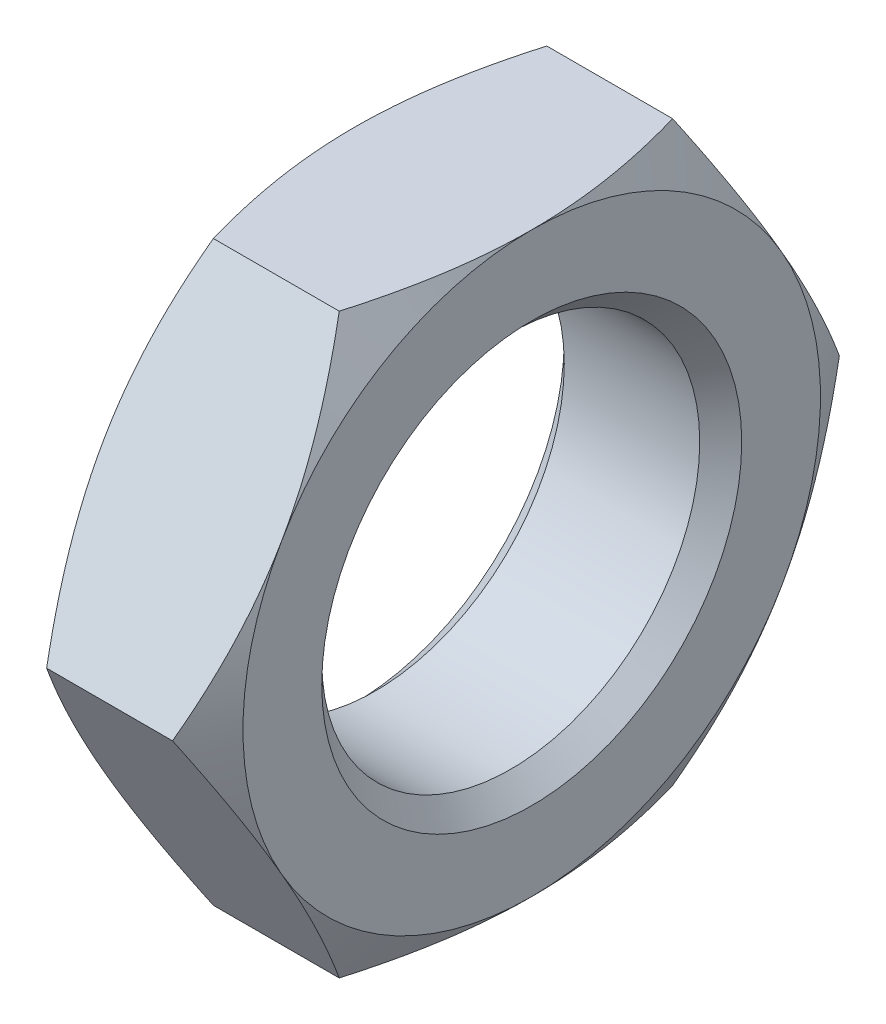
ISO-10303-21;
HEADER;
FILE_DESCRIPTION(('STEP AP214'),'2;1');
FILE_NAME('part.step','',(''),(''),'','','');
FILE_SCHEMA(('AUTOMOTIVE_DESIGN { 1 0 10303 214 1 1 1 1 }'));
ENDSEC;
DATA;
#1=APPLICATION_CONTEXT('core data for automotive mechanical design processes');
#2=APPLICATION_PROTOCOL_DEFINITION('international standard','automotive_design',2000,#1);
#3=PRODUCT_CONTEXT('',#1,'mechanical');
#4=PRODUCT('Part','Part','',(#3));
#5=PRODUCT_RELATED_PRODUCT_CATEGORY('part','',(#4));
#6=PRODUCT_DEFINITION_FORMATION('','',#4);
#7=PRODUCT_DEFINITION_CONTEXT('part definition',#1,'design');
#8=PRODUCT_DEFINITION('design','',#6,#7);
#9=PRODUCT_DEFINITION_SHAPE('','',#8);
#10=(LENGTH_UNIT() NAMED_UNIT(*) SI_UNIT(.MILLI.,.METRE.));
#11=(NAMED_UNIT(*) PLANE_ANGLE_UNIT() SI_UNIT($,.RADIAN.));
#12=(NAMED_UNIT(*) SI_UNIT($,.STERADIAN.) SOLID_ANGLE_UNIT());
#13=UNCERTAINTY_MEASURE_WITH_UNIT(LENGTH_MEASURE(1.E-05),#10,'distance_accuracy_value','');
#14=(GEOMETRIC_REPRESENTATION_CONTEXT(3) GLOBAL_UNCERTAINTY_ASSIGNED_CONTEXT((#13)) GLOBAL_UNIT_ASSIGNED_CONTEXT((#10,
#11,#12)) REPRESENTATION_CONTEXT('',''));
#15=CARTESIAN_POINT('',(0.,0.,0.));
#16=DIRECTION('',(0.,0.,1.));
#17=DIRECTION('',(1.,0.,0.));
#18=AXIS2_PLACEMENT_3D('',#15,#16,#17);
#19=CARTESIAN_POINT('',(16.9,27.5,-15.8771324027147));
#20=DIRECTION('',(1.,0.,0.));
#21=DIRECTION('',(0.,0.,-1.));
#22=AXIS2_PLACEMENT_3D('',#19,#20,#21);
#23=PLANE('',#22);
#24=CARTESIAN_POINT('',(16.9,0.,0.));
#25=DIRECTION('',(1.,0.,0.));
#26=DIRECTION('',(0.,0.,-1.));
#27=AXIS2_PLACEMENT_3D('',#24,#25,#26);
#28=CIRCLE('',#27,20.);
#29=CARTESIAN_POINT('',(16.9,0.,-20.));
#30=VERTEX_POINT('',#29);
#31=EDGE_CURVE('E11',#30,#30,#28,.F.);
#32=ORIENTED_EDGE('',*,*,#31,.T.);
#33=EDGE_LOOP('',(#32));
#34=FACE_BOUND('',#33,.T.);
#35=CARTESIAN_POINT('',(16.9,0.,0.));
#36=DIRECTION('',(1.,0.,0.));
#37=DIRECTION('',(0.,0.,-1.));
#38=AXIS2_PLACEMENT_3D('',#35,#36,#37);
#39=CIRCLE('',#38,27.5);
#40=CARTESIAN_POINT('',(16.9,-27.5,0.));
#41=VERTEX_POINT('',#40);
#42=CARTESIAN_POINT('',(16.9,-13.75,-23.8156986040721));
#43=VERTEX_POINT('',#42);
#44=EDGE_CURVE('E142',#41,#43,#39,.T.);
#45=ORIENTED_EDGE('',*,*,#44,.T.);
#46=CARTESIAN_POINT('',(16.9,13.75,-23.8156986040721));
#47=VERTEX_POINT('',#46);
#48=EDGE_CURVE('E130',#43,#47,#39,.T.);
#49=ORIENTED_EDGE('',*,*,#48,.T.);
#50=CARTESIAN_POINT('',(16.9,27.5,0.));
#51=VERTEX_POINT('',#50);
#52=EDGE_CURVE('E144',#47,#51,#39,.T.);
#53=ORIENTED_EDGE('',*,*,#52,.T.);
#54=CARTESIAN_POINT('',(16.9,13.75,23.8156986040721));
#55=VERTEX_POINT('',#54);
#56=EDGE_CURVE('E55',#51,#55,#39,.T.);
#57=ORIENTED_EDGE('',*,*,#56,.T.);
#58=CARTESIAN_POINT('',(16.9,-13.75,23.8156986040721));
#59=VERTEX_POINT('',#58);
#60=EDGE_CURVE('E63',#55,#59,#39,.T.);
#61=ORIENTED_EDGE('',*,*,#60,.T.);
#62=EDGE_CURVE('E166',#59,#41,#39,.T.);
#63=ORIENTED_EDGE('',*,*,#62,.T.);
#64=EDGE_LOOP('',(#45,#49,#53,#57,#61,#63));
#65=FACE_BOUND('',#64,.T.);
#66=ADVANCED_FACE('F39',(#34,#65),#23,.T.);
#67=CARTESIAN_POINT('',(0.,27.5,-15.8771324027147));
#68=DIRECTION('',(1.,0.,0.));
#69=DIRECTION('',(0.,0.,-1.));
#70=AXIS2_PLACEMENT_3D('',#67,#68,#69);
#71=PLANE('',#70);
#72=CARTESIAN_POINT('',(0.,0.,0.));
#73=DIRECTION('',(1.,0.,0.));
#74=DIRECTION('',(0.,0.,-1.));
#75=AXIS2_PLACEMENT_3D('',#72,#73,#74);
#76=CIRCLE('',#75,20.);
#77=CARTESIAN_POINT('',(0.,0.,-20.));
#78=VERTEX_POINT('',#77);
#79=EDGE_CURVE('E164',#78,#78,#76,.T.);
#80=ORIENTED_EDGE('',*,*,#79,.T.);
#81=EDGE_LOOP('',(#80));
#82=FACE_BOUND('',#81,.T.);
#83=CARTESIAN_POINT('',(0.,0.,0.));
#84=DIRECTION('',(1.,0.,0.));
#85=DIRECTION('',(0.,0.,-1.));
#86=AXIS2_PLACEMENT_3D('',#83,#84,#85);
#87=CIRCLE('',#86,27.5);
#88=CARTESIAN_POINT('',(0.,-13.75,-23.8156986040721));
#89=VERTEX_POINT('',#88);
#90=CARTESIAN_POINT('',(0.,13.75,-23.8156986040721));
#91=VERTEX_POINT('',#90);
#92=EDGE_CURVE('E172',#89,#91,#87,.T.);
#93=ORIENTED_EDGE('',*,*,#92,.F.);
#94=CARTESIAN_POINT('',(0.,-27.5,0.));
#95=VERTEX_POINT('',#94);
#96=EDGE_CURVE('E319',#95,#89,#87,.T.);
#97=ORIENTED_EDGE('',*,*,#96,.F.);
#98=CARTESIAN_POINT('',(0.,-13.75,23.8156986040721));
#99=VERTEX_POINT('',#98);
#100=EDGE_CURVE('E322',#99,#95,#87,.T.);
#101=ORIENTED_EDGE('',*,*,#100,.F.);
#102=CARTESIAN_POINT('',(0.,13.75,23.8156986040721));
#103=VERTEX_POINT('',#102);
#104=EDGE_CURVE('E328',#103,#99,#87,.T.);
#105=ORIENTED_EDGE('',*,*,#104,.F.);
#106=CARTESIAN_POINT('',(0.,27.5,0.));
#107=VERTEX_POINT('',#106);
#108=EDGE_CURVE('E177',#107,#103,#87,.T.);
#109=ORIENTED_EDGE('',*,*,#108,.F.);
#110=EDGE_CURVE('E173',#91,#107,#87,.T.);
#111=ORIENTED_EDGE('',*,*,#110,.F.);
#112=EDGE_LOOP('',(#93,#97,#101,#105,#109,#111));
#113=FACE_BOUND('',#112,.T.);
#114=ADVANCED_FACE('F320',(#82,#113),#71,.F.);
#115=CARTESIAN_POINT('',(16.9,0.,0.));
#116=DIRECTION('',(-1.,0.,0.));
#117=DIRECTION('',(0.,0.,1.));
#118=AXIS2_PLACEMENT_3D('',#115,#116,#117);
#119=CYLINDRICAL_SURFACE('',#118,18.);
#120=CARTESIAN_POINT('',(2.00000000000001,0.,0.));
#121=DIRECTION('',(1.,0.,0.));
#122=DIRECTION('',(0.,0.,-1.));
#123=AXIS2_PLACEMENT_3D('',#120,#121,#122);
#124=CIRCLE('',#123,18.);
#125=CARTESIAN_POINT('',(2.00000000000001,0.,-18.));
#126=VERTEX_POINT('',#125);
#127=EDGE_CURVE('E48',#126,#126,#124,.F.);
#128=ORIENTED_EDGE('',*,*,#127,.T.);
#129=EDGE_LOOP('',(#128));
#130=FACE_BOUND('',#129,.T.);
#131=CARTESIAN_POINT('',(14.9,0.,0.));
#132=DIRECTION('',(1.,0.,0.));
#133=DIRECTION('',(0.,0.,-1.));
#134=AXIS2_PLACEMENT_3D('',#131,#132,#133);
#135=CIRCLE('',#134,18.);
#136=CARTESIAN_POINT('',(14.9,0.,-18.));
#137=VERTEX_POINT('',#136);
#138=EDGE_CURVE('E410',#137,#137,#135,.T.);
#139=ORIENTED_EDGE('',*,*,#138,.T.);
#140=EDGE_LOOP('',(#139));
#141=FACE_BOUND('',#140,.T.);
#142=ADVANCED_FACE('F233',(#130,#141),#119,.F.);
#143=CARTESIAN_POINT('',(0.,0.,0.));
#144=DIRECTION('',(1.,0.,0.));
#145=DIRECTION('',(0.,0.,-1.));
#146=AXIS2_PLACEMENT_3D('',#143,#144,#145);
#147=CONICAL_SURFACE('',#146,27.5,1.0471975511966);
#148=CARTESIAN_POINT('',(2.45626759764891,-27.5002,-15.8770169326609));
#149=CARTESIAN_POINT('',(2.25480335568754,-26.8957622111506,-16.2259892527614));
#150=CARTESIAN_POINT('',(2.06248134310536,-26.2889667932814,-16.5763227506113));
#151=CARTESIAN_POINT('',(1.6986629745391,-25.0705101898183,-17.2797989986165));
#152=CARTESIAN_POINT('',(1.5271734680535,-24.4588474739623,-17.6329426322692));
#153=CARTESIAN_POINT('',(1.20732190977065,-23.229461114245,-18.3427291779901));
#154=CARTESIAN_POINT('',(1.05901508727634,-22.6117266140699,-18.6993783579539));
#155=CARTESIAN_POINT('',(0.788723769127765,-21.371991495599,-19.4151397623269));
#156=CARTESIAN_POINT('',(0.666736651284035,-20.7499913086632,-19.7742517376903));
#157=CARTESIAN_POINT('',(0.454262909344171,-19.5176236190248,-20.4857595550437));
#158=CARTESIAN_POINT('',(0.363073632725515,-18.907347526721,-20.8381026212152));
#159=CARTESIAN_POINT('',(0.210170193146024,-17.683999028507,-21.5444032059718));
#160=CARTESIAN_POINT('',(0.14845659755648,-17.0709265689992,-21.8983607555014));
#161=CARTESIAN_POINT('',(0.0560627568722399,-15.8437518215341,-22.6068704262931));
#162=CARTESIAN_POINT('',(0.0253456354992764,-15.2296516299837,-22.9614213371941));
#163=CARTESIAN_POINT('',(-0.00439469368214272,-14.0008845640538,-23.6708503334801));
#164=CARTESIAN_POINT('',(-0.00341888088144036,-13.3862177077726,-24.025728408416));
#165=CARTESIAN_POINT('',(0.0280129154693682,-12.2370904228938,-24.6891773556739));
#166=CARTESIAN_POINT('',(0.0546360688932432,-11.7025481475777,-24.9977954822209));
#167=CARTESIAN_POINT('',(0.131346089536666,-10.6347397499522,-25.6142949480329));
#168=CARTESIAN_POINT('',(0.181432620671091,-10.1014736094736,-25.9221762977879));
#169=CARTESIAN_POINT('',(0.304201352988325,-9.03641450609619,-26.5370884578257));
#170=CARTESIAN_POINT('',(0.376903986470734,-8.50462331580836,-26.8441182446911));
#171=CARTESIAN_POINT('',(0.543618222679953,-7.44358723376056,-27.4567077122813));
#172=CARTESIAN_POINT('',(0.637629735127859,-6.91434233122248,-27.7622673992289));
#173=CARTESIAN_POINT('',(0.954040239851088,-5.30766765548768,-28.6898814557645));
#174=CARTESIAN_POINT('',(1.20800596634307,-4.23480270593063,-29.3093003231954));
#175=CARTESIAN_POINT('',(1.64037055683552,-2.63735339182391,-30.2315881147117));
#176=CARTESIAN_POINT('',(1.79290583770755,-2.10730271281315,-30.5376130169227));
#177=CARTESIAN_POINT('',(2.11341869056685,-1.05086762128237,-31.1475461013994));
#178=CARTESIAN_POINT('',(2.28139191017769,-0.524482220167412,-31.4514548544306));
#179=CARTESIAN_POINT('',(2.45626759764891,0.000200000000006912,-31.7543802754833));
#180=B_SPLINE_CURVE_WITH_KNOTS('',3,(#148,#149,#150,#151,#152,#153,#154,#155,#156,#157,#158,
#159,#160,#161,#162,#163,#164,#165,#166,#167,#168,#169,#170,#171,#172,#173,#174,#175,#176,#177,
#178,#179),.UNSPECIFIED.,.F.,.F.,(4,2,2,2,2,2,2,2,2,2,2,2,2,2,2,4),(0.,2.17937596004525,
4.35946654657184,6.54467421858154,8.72966408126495,10.8607692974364,12.9919155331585,
15.120523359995,17.2490654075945,19.1020483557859,20.9550047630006,22.8096400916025,
24.6642675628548,28.4552152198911,30.3473870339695,32.2390270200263),.UNSPECIFIED.);
#181=CARTESIAN_POINT('',(2.45620093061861,0.,-31.7542648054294));
#182=VERTEX_POINT('',#181);
#183=EDGE_CURVE('E336',#89,#182,#180,.T.);
#184=ORIENTED_EDGE('',*,*,#183,.F.);
#185=ORIENTED_EDGE('',*,*,#92,.T.);
#186=CARTESIAN_POINT('',(2.45626759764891,-0.00019999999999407,-31.7543802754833));
#187=CARTESIAN_POINT('',(2.25480335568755,0.604237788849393,-31.4054079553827));
#188=CARTESIAN_POINT('',(2.06248134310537,1.21103320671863,-31.0550744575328));
#189=CARTESIAN_POINT('',(1.69866297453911,2.42948981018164,-30.3515982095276));
#190=CARTESIAN_POINT('',(1.5271734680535,3.04115252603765,-29.9984545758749));
#191=CARTESIAN_POINT('',(1.20732190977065,4.27053888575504,-29.288668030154));
#192=CARTESIAN_POINT('',(1.05901508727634,4.88827338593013,-28.9320188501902));
#193=CARTESIAN_POINT('',(0.78872376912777,6.12800850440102,-28.2162574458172));
#194=CARTESIAN_POINT('',(0.666736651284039,6.75000869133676,-27.8571454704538));
#195=CARTESIAN_POINT('',(0.454262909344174,7.98237638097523,-27.1456376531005));
#196=CARTESIAN_POINT('',(0.363073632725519,8.59265247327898,-26.7932945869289));
#197=CARTESIAN_POINT('',(0.210170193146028,9.81600097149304,-26.0869940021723));
#198=CARTESIAN_POINT('',(0.148456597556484,10.4290734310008,-25.7330364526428));
#199=CARTESIAN_POINT('',(0.0560627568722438,11.6562481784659,-25.024526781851));
#200=CARTESIAN_POINT('',(0.0253456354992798,12.2703483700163,-24.66997587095));
#201=CARTESIAN_POINT('',(-0.00439469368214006,13.4991154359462,-23.960546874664));
#202=CARTESIAN_POINT('',(-0.00341888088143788,14.1137822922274,-23.6056687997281));
#203=CARTESIAN_POINT('',(0.0280129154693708,15.2629095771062,-22.9422198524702));
#204=CARTESIAN_POINT('',(0.0546360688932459,15.7974518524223,-22.6336017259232));
#205=CARTESIAN_POINT('',(0.131346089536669,16.8652602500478,-22.0171022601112));
#206=CARTESIAN_POINT('',(0.181432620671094,17.3985263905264,-21.7092209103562));
#207=CARTESIAN_POINT('',(0.304201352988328,18.4635854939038,-21.0943087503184));
#208=CARTESIAN_POINT('',(0.376903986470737,18.9953766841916,-20.787278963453));
#209=CARTESIAN_POINT('',(0.543618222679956,20.0564127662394,-20.1746894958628));
#210=CARTESIAN_POINT('',(0.637629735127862,20.5856576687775,-19.8691298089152));
#211=CARTESIAN_POINT('',(0.954040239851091,22.1923323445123,-18.9415157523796));
#212=CARTESIAN_POINT('',(1.20800596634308,23.2651972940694,-18.3220968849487));
#213=CARTESIAN_POINT('',(1.64037055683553,24.8626466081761,-17.3998090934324));
#214=CARTESIAN_POINT('',(1.79290583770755,25.3926972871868,-17.0937841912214));
#215=CARTESIAN_POINT('',(2.11341869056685,26.4491323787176,-16.4838511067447));
#216=CARTESIAN_POINT('',(2.28139191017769,26.9755177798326,-16.1799423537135));
#217=CARTESIAN_POINT('',(2.45626759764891,27.5002,-15.8770169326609));
#218=B_SPLINE_CURVE_WITH_KNOTS('',3,(#186,#187,#188,#189,#190,#191,#192,#193,#194,#195,#196,
#197,#198,#199,#200,#201,#202,#203,#204,#205,#206,#207,#208,#209,#210,#211,#212,#213,#214,#215,
#216,#217),.UNSPECIFIED.,.F.,.F.,(4,2,2,2,2,2,2,2,2,2,2,2,2,2,2,4),(0.,2.17937596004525,
4.35946654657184,6.54467421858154,8.72966408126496,10.8607692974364,12.9919155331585,
15.120523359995,17.2490654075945,19.1020483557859,20.9550047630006,22.8096400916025,
24.6642675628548,28.4552152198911,30.3473870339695,32.2390270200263),.UNSPECIFIED.);
#219=EDGE_CURVE('E214',#182,#91,#218,.T.);
#220=ORIENTED_EDGE('',*,*,#219,.F.);
#221=EDGE_LOOP('',(#184,#185,#220));
#222=FACE_BOUND('',#221,.T.);
#223=ADVANCED_FACE('F193',(#222),#147,.T.);
#224=ORIENTED_EDGE('',*,*,#96,.T.);
#225=CARTESIAN_POINT('',(2.45620093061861,-27.5,-15.8771324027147));
#226=VERTEX_POINT('',#225);
#227=EDGE_CURVE('E156',#226,#89,#180,.T.);
#228=ORIENTED_EDGE('',*,*,#227,.F.);
#229=CARTESIAN_POINT('',(13.5652953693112,-27.5,-42.9455429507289));
#230=CARTESIAN_POINT('',(13.2727122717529,-27.5,-42.3437621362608));
#231=CARTESIAN_POINT('',(12.981561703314,-27.5,-41.7412827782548));
#232=CARTESIAN_POINT('',(12.4024585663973,-27.5,-40.5347821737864));
#233=CARTESIAN_POINT('',(12.1145060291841,-27.5,-39.9307609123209));
#234=CARTESIAN_POINT('',(11.5420945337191,-27.5,-38.7209523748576));
#235=CARTESIAN_POINT('',(11.2576361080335,-27.5,-38.1151648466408));
#236=CARTESIAN_POINT('',(10.6926575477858,-27.5,-36.9017585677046));
#237=CARTESIAN_POINT('',(10.4121374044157,-27.5,-36.2941398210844));
#238=CARTESIAN_POINT('',(9.57417274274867,-27.5,-34.4618023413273));
#239=CARTESIAN_POINT('',(9.02337654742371,-27.5,-33.2340307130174));
#240=CARTESIAN_POINT('',(7.94389827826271,-27.5,-30.7688229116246));
#241=CARTESIAN_POINT('',(7.41521517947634,-27.5,-29.5313871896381));
#242=CARTESIAN_POINT('',(6.63470985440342,-27.5,-27.645953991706));
#243=CARTESIAN_POINT('',(6.37260457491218,-27.5,-27.0022094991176));
#244=CARTESIAN_POINT('',(5.85690315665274,-27.5,-25.7113251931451));
#245=CARTESIAN_POINT('',(5.60330689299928,-27.5,-25.0641854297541));
#246=CARTESIAN_POINT('',(5.10573719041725,-27.5,-23.7661105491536));
#247=CARTESIAN_POINT('',(4.86176504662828,-27.5,-23.1151749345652));
#248=CARTESIAN_POINT('',(4.38481244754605,-27.5,-21.8092861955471));
#249=CARTESIAN_POINT('',(4.15183194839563,-27.5,-21.1543330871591));
#250=CARTESIAN_POINT('',(3.69882894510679,-27.5,-19.8414035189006));
#251=CARTESIAN_POINT('',(3.47878148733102,-27.5,-19.1834357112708));
#252=CARTESIAN_POINT('',(3.05286863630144,-27.5,-17.8629385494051));
#253=CARTESIAN_POINT('',(2.84700348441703,-27.5,-17.2004091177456));
#254=CARTESIAN_POINT('',(2.25360636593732,-27.5,-15.2059276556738));
#255=CARTESIAN_POINT('',(1.89009933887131,-27.5,-13.8665883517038));
#256=CARTESIAN_POINT('',(1.40701531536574,-27.5,-11.846830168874));
#257=CARTESIAN_POINT('',(1.25668606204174,-27.5,-11.1736921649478));
#258=CARTESIAN_POINT('',(0.978512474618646,-27.5,-9.82275645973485));
#259=CARTESIAN_POINT('',(0.850667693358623,-27.5,-9.14495885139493));
#260=CARTESIAN_POINT('',(0.619703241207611,-27.5,-7.78516991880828));
#261=CARTESIAN_POINT('',(0.516582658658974,-27.5,-7.10317875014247));
#262=CARTESIAN_POINT('',(0.337105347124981,-27.5,-5.73565918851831));
#263=CARTESIAN_POINT('',(0.260748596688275,-27.5,-5.05013079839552));
#264=CARTESIAN_POINT('',(0.137296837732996,-27.5,-3.6856144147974));
#265=CARTESIAN_POINT('',(0.0898263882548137,-27.5,-3.00666059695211));
#266=CARTESIAN_POINT('',(0.0236555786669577,-27.5,-1.64735412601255));
#267=CARTESIAN_POINT('',(0.00495473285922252,-27.5,-0.96700149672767));
#268=CARTESIAN_POINT('',(-0.00323080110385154,-27.5,0.393885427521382));
#269=CARTESIAN_POINT('',(0.00728455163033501,-27.5,1.07441972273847));
#270=CARTESIAN_POINT('',(0.0572712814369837,-27.5,2.43443201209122));
#271=CARTESIAN_POINT('',(0.0967439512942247,-27.5,3.11390995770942));
#272=CARTESIAN_POINT('',(0.22485242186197,-27.5,4.73798294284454));
#273=CARTESIAN_POINT('',(0.326731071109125,-27.5,5.68155236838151));
#274=CARTESIAN_POINT('',(0.580851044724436,-27.5,7.56188876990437));
#275=CARTESIAN_POINT('',(0.733098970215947,-27.5,8.4986548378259));
#276=CARTESIAN_POINT('',(1.08254200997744,-27.5,10.3644235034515));
#277=CARTESIAN_POINT('',(1.27977128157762,-27.5,11.2934196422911));
#278=CARTESIAN_POINT('',(1.7131417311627,-27.5,13.1421916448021));
#279=CARTESIAN_POINT('',(1.94928239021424,-27.5,14.0619676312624));
#280=CARTESIAN_POINT('',(2.46034241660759,-27.5,15.9127061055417));
#281=CARTESIAN_POINT('',(2.73600894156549,-27.5,16.8434608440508));
#282=CARTESIAN_POINT('',(3.31642473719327,-27.5,18.6958040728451));
#283=CARTESIAN_POINT('',(3.62117420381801,-27.5,19.6173925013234));
#284=CARTESIAN_POINT('',(4.25486609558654,-27.5,21.4518569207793));
#285=CARTESIAN_POINT('',(4.58380088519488,-27.5,22.3647355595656));
#286=CARTESIAN_POINT('',(5.09240075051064,-27.5,23.728339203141));
#287=CARTESIAN_POINT('',(5.26446686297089,-27.5,24.1819210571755));
#288=CARTESIAN_POINT('',(5.61324378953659,-27.5,25.0872984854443));
#289=CARTESIAN_POINT('',(5.78995461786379,-27.5,25.5390940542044));
#290=CARTESIAN_POINT('',(6.22077622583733,-27.5,26.6254778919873));
#291=CARTESIAN_POINT('',(6.47697799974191,-27.5,27.2592370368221));
#292=CARTESIAN_POINT('',(6.9968298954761,-27.5,28.5236965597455));
#293=CARTESIAN_POINT('',(7.26048012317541,-27.5,29.1543968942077));
#294=CARTESIAN_POINT('',(8.06131910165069,-27.5,31.0423736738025));
#295=CARTESIAN_POINT('',(8.60837386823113,-27.5,32.2954701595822));
#296=CARTESIAN_POINT('',(9.72334868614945,-27.5,34.792668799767));
#297=CARTESIAN_POINT('',(10.2912738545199,-27.5,36.0367686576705));
#298=CARTESIAN_POINT('',(11.4437020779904,-27.5,38.5172159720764));
#299=CARTESIAN_POINT('',(12.0282047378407,-27.5,39.7535636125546));
#300=CARTESIAN_POINT('',(13.2113113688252,-27.5,42.2212690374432));
#301=CARTESIAN_POINT('',(13.8099311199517,-27.5,43.4526192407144));
#302=CARTESIAN_POINT('',(15.0181537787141,-27.5,45.9099192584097));
#303=CARTESIAN_POINT('',(15.6277567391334,-27.5,47.1358690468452));
#304=CARTESIAN_POINT('',(16.8559423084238,-27.5,49.5830432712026));
#305=CARTESIAN_POINT('',(17.4745236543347,-27.5,50.8042683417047));
#306=CARTESIAN_POINT('',(18.7192408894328,-27.5,53.2428559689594));
#307=CARTESIAN_POINT('',(19.3453767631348,-27.5,54.4602185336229));
#308=CARTESIAN_POINT('',(20.5493683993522,-27.5,56.7861031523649));
#309=CARTESIAN_POINT('',(21.1266962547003,-27.5,57.8948986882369));
#310=CARTESIAN_POINT('',(22.2859194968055,-27.5,60.110100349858));
#311=CARTESIAN_POINT('',(22.8678148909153,-27.5,61.2165064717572));
#312=CARTESIAN_POINT('',(24.6194459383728,-27.5,64.5326881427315));
#313=CARTESIAN_POINT('',(25.7950848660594,-27.5,66.7393468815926));
#314=CARTESIAN_POINT('',(27.5659683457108,-27.5,70.0415821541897));
#315=CARTESIAN_POINT('',(28.1567098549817,-27.5,71.1395800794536));
#316=CARTESIAN_POINT('',(29.3408386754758,-27.5,73.334149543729));
#317=CARTESIAN_POINT('',(29.9342259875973,-27.5,74.4307210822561));
#318=CARTESIAN_POINT('',(31.1233000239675,-27.5,76.6225329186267));
#319=CARTESIAN_POINT('',(31.7189866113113,-27.5,77.717773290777));
#320=CARTESIAN_POINT('',(32.9124424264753,-27.5,79.9071166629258));
#321=CARTESIAN_POINT('',(33.5102116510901,-27.5,81.0012196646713));
#322=CARTESIAN_POINT('',(34.1088974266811,-27.5,82.0948203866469));
#323=B_SPLINE_CURVE_WITH_KNOTS('',3,(#229,#230,#231,#232,#233,#234,#235,#236,#237,#238,#239,
#240,#241,#242,#243,#244,#245,#246,#247,#248,#249,#250,#251,#252,#253,#254,#255,#256,#257,#258,
#259,#260,#261,#262,#263,#264,#265,#266,#267,#268,#269,#270,#271,#272,#273,#274,#275,#276,#277,
#278,#279,#280,#281,#282,#283,#284,#285,#286,#287,#288,#289,#290,#291,#292,#293,#294,#295,#296,
#297,#298,#299,#300,#301,#302,#303,#304,#305,#306,#307,#308,#309,#310,#311,#312,#313,#314,#315,
#316,#317,#318,#319,#320,#321,#322),.UNSPECIFIED.,.F.,.F.,(4,2,2,2,2,2,2,2,2,2,2,2,2,2,2,2,2,2,
2,2,2,2,2,2,2,2,2,2,2,2,2,2,2,2,2,2,2,2,2,2,2,2,2,2,2,2,4),(0.,2.00741328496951,
4.01484617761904,6.02258133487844,8.03031200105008,12.0671203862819,16.1037414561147,
18.1888673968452,20.273962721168,22.3593376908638,24.444704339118,26.5259055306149,
28.6071421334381,32.7680456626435,34.8369038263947,36.9057208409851,38.97446156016,
41.0432006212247,43.0844431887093,45.1256512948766,47.1668622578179,49.2081643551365,
52.0537569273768,54.8997225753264,57.7478565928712,60.595952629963,63.5075433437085,
66.4191536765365,69.3298487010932,70.7851942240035,72.2405442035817,74.2912454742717,
76.341975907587,80.4436168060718,84.5462701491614,88.6488257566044,92.7562076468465,
96.8636092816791,100.970438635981,105.07725957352,108.827529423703,112.577805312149,
120.078627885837,123.819103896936,127.559581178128,131.299839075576,135.040091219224),.UNSPECIFIED.);
#324=EDGE_CURVE('E176',#95,#226,#323,.F.);
#325=ORIENTED_EDGE('',*,*,#324,.F.);
#326=EDGE_LOOP('',(#224,#228,#325));
#327=FACE_BOUND('',#326,.T.);
#328=ADVANCED_FACE('F352',(#327),#147,.T.);
#329=CARTESIAN_POINT('',(8.45,0.,0.));
#330=DIRECTION('',(-1.,0.,0.));
#331=DIRECTION('',(0.,0.,1.));
#332=AXIS2_PLACEMENT_3D('',#329,#330,#331);
#333=CONICAL_SURFACE('',#332,42.1358293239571,1.0471975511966);
#334=CARTESIAN_POINT('',(14.4437324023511,0.000200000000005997,-31.7543802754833));
#335=CARTESIAN_POINT('',(14.6451966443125,-0.60423778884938,-31.4054079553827));
#336=CARTESIAN_POINT('',(14.8375186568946,-1.21103320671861,-31.0550744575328));
#337=CARTESIAN_POINT('',(15.2013370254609,-2.42948981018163,-30.3515982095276));
#338=CARTESIAN_POINT('',(15.3728265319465,-3.04115252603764,-29.9984545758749));
#339=CARTESIAN_POINT('',(15.6926780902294,-4.27053888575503,-29.288668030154));
#340=CARTESIAN_POINT('',(15.8409849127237,-4.88827338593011,-28.9320188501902));
#341=CARTESIAN_POINT('',(16.1112762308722,-6.12800850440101,-28.2162574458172));
#342=CARTESIAN_POINT('',(16.233263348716,-6.75000869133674,-27.8571454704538));
#343=CARTESIAN_POINT('',(16.4457370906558,-7.98237638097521,-27.1456376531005));
#344=CARTESIAN_POINT('',(16.5369263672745,-8.59265247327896,-26.7932945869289));
#345=CARTESIAN_POINT('',(16.689829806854,-9.81600097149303,-26.0869940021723));
#346=CARTESIAN_POINT('',(16.7515434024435,-10.4290734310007,-25.7330364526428));
#347=CARTESIAN_POINT('',(16.8439372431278,-11.6562481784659,-25.024526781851));
#348=CARTESIAN_POINT('',(16.8746543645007,-12.2703483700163,-24.66997587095));
#349=CARTESIAN_POINT('',(16.9043946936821,-13.4991154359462,-23.960546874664));
#350=CARTESIAN_POINT('',(16.9034188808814,-14.1137822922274,-23.6056687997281));
#351=CARTESIAN_POINT('',(16.8719870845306,-15.2629095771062,-22.9422198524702));
#352=CARTESIAN_POINT('',(16.8453639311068,-15.7974518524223,-22.6336017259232));
#353=CARTESIAN_POINT('',(16.7686539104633,-16.8652602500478,-22.0171022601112));
#354=CARTESIAN_POINT('',(16.7185673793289,-17.3985263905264,-21.7092209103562));
#355=CARTESIAN_POINT('',(16.5957986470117,-18.4635854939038,-21.0943087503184));
#356=CARTESIAN_POINT('',(16.5230960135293,-18.9953766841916,-20.787278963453));
#357=CARTESIAN_POINT('',(16.35638177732,-20.0564127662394,-20.1746894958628));
#358=CARTESIAN_POINT('',(16.2623702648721,-20.5856576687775,-19.8691298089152));
#359=CARTESIAN_POINT('',(15.9459597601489,-22.1923323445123,-18.9415157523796));
#360=CARTESIAN_POINT('',(15.6919940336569,-23.2651972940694,-18.3220968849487));
#361=CARTESIAN_POINT('',(15.2596294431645,-24.8626466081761,-17.3998090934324));
#362=CARTESIAN_POINT('',(15.1070941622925,-25.3926972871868,-17.0937841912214));
#363=CARTESIAN_POINT('',(14.7865813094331,-26.4491323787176,-16.4838511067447));
#364=CARTESIAN_POINT('',(14.6186080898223,-26.9755177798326,-16.1799423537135));
#365=CARTESIAN_POINT('',(14.4437324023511,-27.5002,-15.8770169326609));
#366=B_SPLINE_CURVE_WITH_KNOTS('',3,(#334,#335,#336,#337,#338,#339,#340,#341,#342,#343,#344,
#345,#346,#347,#348,#349,#350,#351,#352,#353,#354,#355,#356,#357,#358,#359,#360,#361,#362,#363,
#364,#365),.UNSPECIFIED.,.F.,.F.,(4,2,2,2,2,2,2,2,2,2,2,2,2,2,2,4),(0.,2.17937596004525,
4.35946654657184,6.54467421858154,8.72966408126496,10.8607692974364,12.9919155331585,
15.120523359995,17.2490654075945,19.1020483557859,20.9550047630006,22.8096400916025,
24.6642675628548,28.4552152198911,30.3473870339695,32.2390270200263),.UNSPECIFIED.);
#367=CARTESIAN_POINT('',(14.4437990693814,-27.5,-15.8771324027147));
#368=VERTEX_POINT('',#367);
#369=EDGE_CURVE('E147',#43,#368,#366,.T.);
#370=ORIENTED_EDGE('',*,*,#369,.F.);
#371=ORIENTED_EDGE('',*,*,#44,.F.);
#372=CARTESIAN_POINT('',(3.33470463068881,-27.5,-42.9455429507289));
#373=CARTESIAN_POINT('',(3.62728772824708,-27.5,-42.3437621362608));
#374=CARTESIAN_POINT('',(3.91843829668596,-27.5,-41.7412827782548));
#375=CARTESIAN_POINT('',(4.49754143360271,-27.5,-40.5347821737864));
#376=CARTESIAN_POINT('',(4.7854939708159,-27.5,-39.9307609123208));
#377=CARTESIAN_POINT('',(5.35790546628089,-27.5,-38.7209523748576));
#378=CARTESIAN_POINT('',(5.64236389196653,-27.5,-38.1151648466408));
#379=CARTESIAN_POINT('',(6.20734245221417,-27.5,-36.9017585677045));
#380=CARTESIAN_POINT('',(6.48786259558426,-27.5,-36.2941398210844));
#381=CARTESIAN_POINT('',(7.32582725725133,-27.5,-34.4618023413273));
#382=CARTESIAN_POINT('',(7.8766234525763,-27.5,-33.2340307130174));
#383=CARTESIAN_POINT('',(8.9561017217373,-27.5,-30.7688229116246));
#384=CARTESIAN_POINT('',(9.48478482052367,-27.5,-29.5313871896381));
#385=CARTESIAN_POINT('',(10.2652901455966,-27.5,-27.645953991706));
#386=CARTESIAN_POINT('',(10.5273954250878,-27.5,-27.0022094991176));
#387=CARTESIAN_POINT('',(11.0430968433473,-27.5,-25.7113251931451));
#388=CARTESIAN_POINT('',(11.2966931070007,-27.5,-25.0641854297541));
#389=CARTESIAN_POINT('',(11.7942628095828,-27.5,-23.7661105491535));
#390=CARTESIAN_POINT('',(12.0382349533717,-27.5,-23.1151749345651));
#391=CARTESIAN_POINT('',(12.515187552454,-27.5,-21.8092861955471));
#392=CARTESIAN_POINT('',(12.7481680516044,-27.5,-21.1543330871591));
#393=CARTESIAN_POINT('',(13.2011710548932,-27.5,-19.8414035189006));
#394=CARTESIAN_POINT('',(13.421218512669,-27.5,-19.1834357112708));
#395=CARTESIAN_POINT('',(13.8471313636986,-27.5,-17.8629385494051));
#396=CARTESIAN_POINT('',(14.052996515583,-27.5,-17.2004091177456));
#397=CARTESIAN_POINT('',(14.6463936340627,-27.5,-15.2059276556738));
#398=CARTESIAN_POINT('',(15.0099006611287,-27.5,-13.8665883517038));
#399=CARTESIAN_POINT('',(15.4929846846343,-27.5,-11.846830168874));
#400=CARTESIAN_POINT('',(15.6433139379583,-27.5,-11.1736921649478));
#401=CARTESIAN_POINT('',(15.9214875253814,-27.5,-9.82275645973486));
#402=CARTESIAN_POINT('',(16.0493323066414,-27.5,-9.14495885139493));
#403=CARTESIAN_POINT('',(16.2802967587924,-27.5,-7.78516991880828));
#404=CARTESIAN_POINT('',(16.383417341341,-27.5,-7.10317875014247));
#405=CARTESIAN_POINT('',(16.562894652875,-27.5,-5.73565918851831));
#406=CARTESIAN_POINT('',(16.6392514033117,-27.5,-5.05013079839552));
#407=CARTESIAN_POINT('',(16.762703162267,-27.5,-3.68561441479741));
#408=CARTESIAN_POINT('',(16.8101736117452,-27.5,-3.00666059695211));
#409=CARTESIAN_POINT('',(16.876344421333,-27.5,-1.64735412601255));
#410=CARTESIAN_POINT('',(16.8950452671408,-27.5,-0.967001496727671));
#411=CARTESIAN_POINT('',(16.9032308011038,-27.5,0.393885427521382));
#412=CARTESIAN_POINT('',(16.8927154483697,-27.5,1.07441972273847));
#413=CARTESIAN_POINT('',(16.842728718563,-27.5,2.43443201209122));
#414=CARTESIAN_POINT('',(16.8032560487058,-27.5,3.11390995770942));
#415=CARTESIAN_POINT('',(16.675147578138,-27.5,4.73798294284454));
#416=CARTESIAN_POINT('',(16.5732689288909,-27.5,5.68155236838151));
#417=CARTESIAN_POINT('',(16.3191489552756,-27.5,7.56188876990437));
#418=CARTESIAN_POINT('',(16.1669010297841,-27.5,8.49865483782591));
#419=CARTESIAN_POINT('',(15.8174579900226,-27.5,10.3644235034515));
#420=CARTESIAN_POINT('',(15.6202287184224,-27.5,11.2934196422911));
#421=CARTESIAN_POINT('',(15.1868582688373,-27.5,13.1421916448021));
#422=CARTESIAN_POINT('',(14.9507176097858,-27.5,14.0619676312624));
#423=CARTESIAN_POINT('',(14.4396575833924,-27.5,15.9127061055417));
#424=CARTESIAN_POINT('',(14.1639910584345,-27.5,16.8434608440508));
#425=CARTESIAN_POINT('',(13.5835752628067,-27.5,18.6958040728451));
#426=CARTESIAN_POINT('',(13.278825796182,-27.5,19.6173925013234));
#427=CARTESIAN_POINT('',(12.6451339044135,-27.5,21.4518569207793));
#428=CARTESIAN_POINT('',(12.3161991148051,-27.5,22.3647355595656));
#429=CARTESIAN_POINT('',(11.8075992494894,-27.5,23.7283392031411));
#430=CARTESIAN_POINT('',(11.6355331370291,-27.5,24.1819210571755));
#431=CARTESIAN_POINT('',(11.2867562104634,-27.5,25.0872984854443));
#432=CARTESIAN_POINT('',(11.1100453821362,-27.5,25.5390940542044));
#433=CARTESIAN_POINT('',(10.6792237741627,-27.5,26.6254778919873));
#434=CARTESIAN_POINT('',(10.4230220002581,-27.5,27.2592370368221));
#435=CARTESIAN_POINT('',(9.90317010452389,-27.5,28.5236965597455));
#436=CARTESIAN_POINT('',(9.63951987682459,-27.5,29.1543968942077));
#437=CARTESIAN_POINT('',(8.83868089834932,-27.5,31.0423736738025));
#438=CARTESIAN_POINT('',(8.29162613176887,-27.5,32.2954701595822));
#439=CARTESIAN_POINT('',(7.17665131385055,-27.5,34.792668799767));
#440=CARTESIAN_POINT('',(6.60872614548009,-27.5,36.0367686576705));
#441=CARTESIAN_POINT('',(5.45629792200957,-27.5,38.5172159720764));
#442=CARTESIAN_POINT('',(4.87179526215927,-27.5,39.7535636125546));
#443=CARTESIAN_POINT('',(3.68868863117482,-27.5,42.2212690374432));
#444=CARTESIAN_POINT('',(3.09006888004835,-27.5,43.4526192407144));
#445=CARTESIAN_POINT('',(1.8818462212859,-27.5,45.9099192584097));
#446=CARTESIAN_POINT('',(1.27224326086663,-27.5,47.1358690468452));
#447=CARTESIAN_POINT('',(0.0440576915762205,-27.5,49.5830432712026));
#448=CARTESIAN_POINT('',(-0.574523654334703,-27.5,50.8042683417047));
#449=CARTESIAN_POINT('',(-1.81924088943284,-27.5,53.2428559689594));
#450=CARTESIAN_POINT('',(-2.44537676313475,-27.5,54.4602185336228));
#451=CARTESIAN_POINT('',(-3.64936839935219,-27.5,56.7861031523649));
#452=CARTESIAN_POINT('',(-4.2266962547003,-27.5,57.8948986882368));
#453=CARTESIAN_POINT('',(-5.38591949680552,-27.5,60.110100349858));
#454=CARTESIAN_POINT('',(-5.96781489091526,-27.5,61.2165064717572));
#455=CARTESIAN_POINT('',(-7.7194459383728,-27.5,64.5326881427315));
#456=CARTESIAN_POINT('',(-8.89508486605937,-27.5,66.7393468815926));
#457=CARTESIAN_POINT('',(-10.6659683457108,-27.5,70.0415821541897));
#458=CARTESIAN_POINT('',(-11.2567098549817,-27.5,71.1395800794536));
#459=CARTESIAN_POINT('',(-12.4408386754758,-27.5,73.334149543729));
#460=CARTESIAN_POINT('',(-13.0342259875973,-27.5,74.430721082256));
#461=CARTESIAN_POINT('',(-14.2233000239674,-27.5,76.6225329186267));
#462=CARTESIAN_POINT('',(-14.8189866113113,-27.5,77.717773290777));
#463=CARTESIAN_POINT('',(-16.0124424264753,-27.5,79.9071166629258));
#464=CARTESIAN_POINT('',(-16.6102116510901,-27.5,81.0012196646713));
#465=CARTESIAN_POINT('',(-17.2088974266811,-27.5,82.0948203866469));
#466=B_SPLINE_CURVE_WITH_KNOTS('',3,(#372,#373,#374,#375,#376,#377,#378,#379,#380,#381,#382,
#383,#384,#385,#386,#387,#388,#389,#390,#391,#392,#393,#394,#395,#396,#397,#398,#399,#400,#401,
#402,#403,#404,#405,#406,#407,#408,#409,#410,#411,#412,#413,#414,#415,#416,#417,#418,#419,#420,
#421,#422,#423,#424,#425,#426,#427,#428,#429,#430,#431,#432,#433,#434,#435,#436,#437,#438,#439,
#440,#441,#442,#443,#444,#445,#446,#447,#448,#449,#450,#451,#452,#453,#454,#455,#456,#457,#458,
#459,#460,#461,#462,#463,#464,#465),.UNSPECIFIED.,.F.,.F.,(4,2,2,2,2,2,2,2,2,2,2,2,2,2,2,2,2,2,
2,2,2,2,2,2,2,2,2,2,2,2,2,2,2,2,2,2,2,2,2,2,2,2,2,2,2,2,4),(0.,2.00741328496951,
4.01484617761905,6.02258133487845,8.0303120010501,12.0671203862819,16.1037414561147,
18.1888673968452,20.273962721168,22.3593376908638,24.444704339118,26.5259055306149,
28.6071421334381,32.7680456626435,34.8369038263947,36.9057208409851,38.97446156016,
41.0432006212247,43.0844431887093,45.1256512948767,47.1668622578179,49.2081643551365,
52.0537569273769,54.8997225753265,57.7478565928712,60.595952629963,63.5075433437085,
66.4191536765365,69.3298487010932,70.7851942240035,72.2405442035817,74.2912454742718,
76.341975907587,80.4436168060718,84.5462701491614,88.6488257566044,92.7562076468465,
96.8636092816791,100.970438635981,105.07725957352,108.827529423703,112.577805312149,
120.078627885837,123.819103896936,127.559581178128,131.299839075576,135.040091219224),.UNSPECIFIED.);
#467=EDGE_CURVE('E151',#368,#41,#466,.T.);
#468=ORIENTED_EDGE('',*,*,#467,.F.);
#469=EDGE_LOOP('',(#370,#371,#468));
#470=FACE_BOUND('',#469,.T.);
#471=ADVANCED_FACE('F148',(#470),#333,.T.);
#472=ORIENTED_EDGE('',*,*,#48,.F.);
#473=CARTESIAN_POINT('',(14.4437990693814,0.,-31.7542648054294));
#474=VERTEX_POINT('',#473);
#475=EDGE_CURVE('E134',#474,#43,#366,.T.);
#476=ORIENTED_EDGE('',*,*,#475,.F.);
#477=CARTESIAN_POINT('',(14.4437324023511,27.5002,-15.8770169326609));
#478=CARTESIAN_POINT('',(14.6451966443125,26.8957622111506,-16.2259892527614));
#479=CARTESIAN_POINT('',(14.8375186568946,26.2889667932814,-16.5763227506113));
#480=CARTESIAN_POINT('',(15.2013370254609,25.0705101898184,-17.2797989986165));
#481=CARTESIAN_POINT('',(15.3728265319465,24.4588474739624,-17.6329426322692));
#482=CARTESIAN_POINT('',(15.6926780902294,23.229461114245,-18.3427291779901));
#483=CARTESIAN_POINT('',(15.8409849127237,22.6117266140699,-18.6993783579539));
#484=CARTESIAN_POINT('',(16.1112762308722,21.371991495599,-19.4151397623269));
#485=CARTESIAN_POINT('',(16.233263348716,20.7499913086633,-19.7742517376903));
#486=CARTESIAN_POINT('',(16.4457370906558,19.5176236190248,-20.4857595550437));
#487=CARTESIAN_POINT('',(16.5369263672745,18.907347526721,-20.8381026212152));
#488=CARTESIAN_POINT('',(16.689829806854,17.683999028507,-21.5444032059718));
#489=CARTESIAN_POINT('',(16.7515434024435,17.0709265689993,-21.8983607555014));
#490=CARTESIAN_POINT('',(16.8439372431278,15.8437518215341,-22.6068704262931));
#491=CARTESIAN_POINT('',(16.8746543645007,15.2296516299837,-22.9614213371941));
#492=CARTESIAN_POINT('',(16.9043946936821,14.0008845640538,-23.6708503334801));
#493=CARTESIAN_POINT('',(16.9034188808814,13.3862177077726,-24.025728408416));
#494=CARTESIAN_POINT('',(16.8719870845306,12.2370904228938,-24.6891773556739));
#495=CARTESIAN_POINT('',(16.8453639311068,11.7025481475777,-24.9977954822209));
#496=CARTESIAN_POINT('',(16.7686539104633,10.6347397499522,-25.6142949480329));
#497=CARTESIAN_POINT('',(16.7185673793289,10.1014736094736,-25.9221762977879));
#498=CARTESIAN_POINT('',(16.5957986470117,9.03641450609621,-26.5370884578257));
#499=CARTESIAN_POINT('',(16.5230960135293,8.50462331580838,-26.8441182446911));
#500=CARTESIAN_POINT('',(16.35638177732,7.44358723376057,-27.4567077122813));
#501=CARTESIAN_POINT('',(16.2623702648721,6.91434233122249,-27.7622673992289));
#502=CARTESIAN_POINT('',(15.9459597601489,5.30766765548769,-28.6898814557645));
#503=CARTESIAN_POINT('',(15.6919940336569,4.23480270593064,-29.3093003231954));
#504=CARTESIAN_POINT('',(15.2596294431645,2.63735339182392,-30.2315881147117));
#505=CARTESIAN_POINT('',(15.1070941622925,2.10730271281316,-30.5376130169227));
#506=CARTESIAN_POINT('',(14.7865813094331,1.05086762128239,-31.1475461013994));
#507=CARTESIAN_POINT('',(14.6186080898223,0.524482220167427,-31.4514548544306));
#508=CARTESIAN_POINT('',(14.4437324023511,-0.000199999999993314,-31.7543802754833));
#509=B_SPLINE_CURVE_WITH_KNOTS('',3,(#477,#478,#479,#480,#481,#482,#483,#484,#485,#486,#487,
#488,#489,#490,#491,#492,#493,#494,#495,#496,#497,#498,#499,#500,#501,#502,#503,#504,#505,#506,
#507,#508),.UNSPECIFIED.,.F.,.F.,(4,2,2,2,2,2,2,2,2,2,2,2,2,2,2,4),(0.,2.17937596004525,
4.35946654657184,6.54467421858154,8.72966408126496,10.8607692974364,12.9919155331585,
15.120523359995,17.2490654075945,19.1020483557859,20.9550047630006,22.8096400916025,
24.6642675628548,28.4552152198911,30.3473870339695,32.2390270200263),.UNSPECIFIED.);
#510=EDGE_CURVE('E136',#47,#474,#509,.T.);
#511=ORIENTED_EDGE('',*,*,#510,.F.);
#512=EDGE_LOOP('',(#472,#476,#511));
#513=FACE_BOUND('',#512,.T.);
#514=ADVANCED_FACE('F132',(#513),#333,.T.);
#515=ORIENTED_EDGE('',*,*,#100,.T.);
#516=CARTESIAN_POINT('',(2.45620093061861,-27.5,15.8771324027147));
#517=VERTEX_POINT('',#516);
#518=EDGE_CURVE('E186',#517,#95,#323,.F.);
#519=ORIENTED_EDGE('',*,*,#518,.F.);
#520=CARTESIAN_POINT('',(2.45626759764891,0.000200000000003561,31.7543802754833));
#521=CARTESIAN_POINT('',(2.25480335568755,-0.604237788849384,31.4054079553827));
#522=CARTESIAN_POINT('',(2.06248134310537,-1.21103320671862,31.0550744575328));
#523=CARTESIAN_POINT('',(1.69866297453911,-2.42948981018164,30.3515982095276));
#524=CARTESIAN_POINT('',(1.5271734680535,-3.04115252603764,29.9984545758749));
#525=CARTESIAN_POINT('',(1.20732190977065,-4.27053888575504,29.288668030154));
#526=CARTESIAN_POINT('',(1.05901508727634,-4.88827338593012,28.9320188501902));
#527=CARTESIAN_POINT('',(0.78872376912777,-6.12800850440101,28.2162574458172));
#528=CARTESIAN_POINT('',(0.666736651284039,-6.75000869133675,27.8571454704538));
#529=CARTESIAN_POINT('',(0.454262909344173,-7.98237638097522,27.1456376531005));
#530=CARTESIAN_POINT('',(0.363073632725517,-8.59265247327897,26.7932945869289));
#531=CARTESIAN_POINT('',(0.210170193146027,-9.81600097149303,26.0869940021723));
#532=CARTESIAN_POINT('',(0.148456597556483,-10.4290734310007,25.7330364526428));
#533=CARTESIAN_POINT('',(0.0560627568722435,-11.6562481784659,25.024526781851));
#534=CARTESIAN_POINT('',(0.0253456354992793,-12.2703483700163,24.66997587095));
#535=CARTESIAN_POINT('',(-0.00439469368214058,-13.4991154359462,23.960546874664));
#536=CARTESIAN_POINT('',(-0.00341888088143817,-14.1137822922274,23.6056687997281));
#537=CARTESIAN_POINT('',(0.0280129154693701,-15.2629095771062,22.9422198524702));
#538=CARTESIAN_POINT('',(0.0546360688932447,-15.7974518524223,22.6336017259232));
#539=CARTESIAN_POINT('',(0.131346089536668,-16.8652602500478,22.0171022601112));
#540=CARTESIAN_POINT('',(0.181432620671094,-17.3985263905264,21.7092209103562));
#541=CARTESIAN_POINT('',(0.304201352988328,-18.4635854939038,21.0943087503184));
#542=CARTESIAN_POINT('',(0.376903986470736,-18.9953766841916,20.787278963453));
#543=CARTESIAN_POINT('',(0.543618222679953,-20.0564127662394,20.1746894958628));
#544=CARTESIAN_POINT('',(0.63762973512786,-20.5856576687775,19.8691298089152));
#545=CARTESIAN_POINT('',(0.954040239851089,-22.1923323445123,18.9415157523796));
#546=CARTESIAN_POINT('',(1.20800596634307,-23.2651972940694,18.3220968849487));
#547=CARTESIAN_POINT('',(1.64037055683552,-24.8626466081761,17.3998090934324));
#548=CARTESIAN_POINT('',(1.79290583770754,-25.3926972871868,17.0937841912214));
#549=CARTESIAN_POINT('',(2.11341869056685,-26.4491323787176,16.4838511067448));
#550=CARTESIAN_POINT('',(2.28139191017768,-26.9755177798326,16.1799423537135));
#551=CARTESIAN_POINT('',(2.45626759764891,-27.5002,15.8770169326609));
#552=B_SPLINE_CURVE_WITH_KNOTS('',3,(#520,#521,#522,#523,#524,#525,#526,#527,#528,#529,#530,
#531,#532,#533,#534,#535,#536,#537,#538,#539,#540,#541,#542,#543,#544,#545,#546,#547,#548,#549,
#550,#551),.UNSPECIFIED.,.F.,.F.,(4,2,2,2,2,2,2,2,2,2,2,2,2,2,2,4),(0.,2.17937596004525,
4.35946654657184,6.54467421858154,8.72966408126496,10.8607692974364,12.9919155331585,
15.120523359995,17.2490654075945,19.1020483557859,20.9550047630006,22.8096400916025,
24.6642675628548,28.4552152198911,30.3473870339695,32.2390270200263),.UNSPECIFIED.);
#553=EDGE_CURVE('E187',#99,#517,#552,.T.);
#554=ORIENTED_EDGE('',*,*,#553,.F.);
#555=EDGE_LOOP('',(#515,#519,#554));
#556=FACE_BOUND('',#555,.T.);
#557=ADVANCED_FACE('F351',(#556),#147,.T.);
#558=CARTESIAN_POINT('',(14.4437990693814,-27.5,15.8771324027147));
#559=VERTEX_POINT('',#558);
#560=EDGE_CURVE('E215',#41,#559,#466,.T.);
#561=ORIENTED_EDGE('',*,*,#560,.F.);
#562=ORIENTED_EDGE('',*,*,#62,.F.);
#563=CARTESIAN_POINT('',(14.4437324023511,-27.5002,15.8770169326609));
#564=CARTESIAN_POINT('',(14.6451966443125,-26.8957622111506,16.2259892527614));
#565=CARTESIAN_POINT('',(14.8375186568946,-26.2889667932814,16.5763227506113));
#566=CARTESIAN_POINT('',(15.2013370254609,-25.0705101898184,17.2797989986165));
#567=CARTESIAN_POINT('',(15.3728265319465,-24.4588474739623,17.6329426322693));
#568=CARTESIAN_POINT('',(15.6926780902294,-23.229461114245,18.3427291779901));
#569=CARTESIAN_POINT('',(15.8409849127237,-22.6117266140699,18.6993783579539));
#570=CARTESIAN_POINT('',(16.1112762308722,-21.371991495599,19.4151397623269));
#571=CARTESIAN_POINT('',(16.233263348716,-20.7499913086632,19.7742517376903));
#572=CARTESIAN_POINT('',(16.4457370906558,-19.5176236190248,20.4857595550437));
#573=CARTESIAN_POINT('',(16.5369263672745,-18.907347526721,20.8381026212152));
#574=CARTESIAN_POINT('',(16.689829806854,-17.683999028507,21.5444032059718));
#575=CARTESIAN_POINT('',(16.7515434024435,-17.0709265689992,21.8983607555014));
#576=CARTESIAN_POINT('',(16.8439372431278,-15.8437518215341,22.6068704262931));
#577=CARTESIAN_POINT('',(16.8746543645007,-15.2296516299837,22.9614213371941));
#578=CARTESIAN_POINT('',(16.9043946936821,-14.0008845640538,23.6708503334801));
#579=CARTESIAN_POINT('',(16.9034188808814,-13.3862177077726,24.025728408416));
#580=CARTESIAN_POINT('',(16.8719870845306,-12.2370904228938,24.6891773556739));
#581=CARTESIAN_POINT('',(16.8453639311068,-11.7025481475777,24.9977954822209));
#582=CARTESIAN_POINT('',(16.7686539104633,-10.6347397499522,25.6142949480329));
#583=CARTESIAN_POINT('',(16.7185673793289,-10.1014736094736,25.9221762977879));
#584=CARTESIAN_POINT('',(16.5957986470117,-9.03641450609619,26.5370884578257));
#585=CARTESIAN_POINT('',(16.5230960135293,-8.50462331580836,26.8441182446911));
#586=CARTESIAN_POINT('',(16.35638177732,-7.44358723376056,27.4567077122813));
#587=CARTESIAN_POINT('',(16.2623702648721,-6.91434233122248,27.7622673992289));
#588=CARTESIAN_POINT('',(15.9459597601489,-5.30766765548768,28.6898814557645));
#589=CARTESIAN_POINT('',(15.6919940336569,-4.23480270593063,29.3093003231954));
#590=CARTESIAN_POINT('',(15.2596294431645,-2.63735339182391,30.2315881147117));
#591=CARTESIAN_POINT('',(15.1070941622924,-2.10730271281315,30.5376130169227));
#592=CARTESIAN_POINT('',(14.7865813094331,-1.05086762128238,31.1475461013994));
#593=CARTESIAN_POINT('',(14.6186080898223,-0.524482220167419,31.4514548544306));
#594=CARTESIAN_POINT('',(14.4437324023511,0.00020000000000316,31.7543802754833));
#595=B_SPLINE_CURVE_WITH_KNOTS('',3,(#563,#564,#565,#566,#567,#568,#569,#570,#571,#572,#573,
#574,#575,#576,#577,#578,#579,#580,#581,#582,#583,#584,#585,#586,#587,#588,#589,#590,#591,#592,
#593,#594),.UNSPECIFIED.,.F.,.F.,(4,2,2,2,2,2,2,2,2,2,2,2,2,2,2,4),(0.,2.17937596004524,
4.35946654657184,6.54467421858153,8.72966408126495,10.8607692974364,12.9919155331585,
15.120523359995,17.2490654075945,19.1020483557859,20.9550047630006,22.8096400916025,
24.6642675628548,28.4552152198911,30.3473870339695,32.2390270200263),.UNSPECIFIED.);
#596=EDGE_CURVE('E246',#559,#59,#595,.T.);
#597=ORIENTED_EDGE('',*,*,#596,.F.);
#598=EDGE_LOOP('',(#561,#562,#597));
#599=FACE_BOUND('',#598,.T.);
#600=ADVANCED_FACE('F396',(#599),#333,.T.);
#601=ORIENTED_EDGE('',*,*,#104,.T.);
#602=CARTESIAN_POINT('',(2.45620093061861,0.,31.7542648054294));
#603=VERTEX_POINT('',#602);
#604=EDGE_CURVE('E286',#603,#99,#552,.T.);
#605=ORIENTED_EDGE('',*,*,#604,.F.);
#606=CARTESIAN_POINT('',(2.45626759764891,27.5002,15.8770169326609));
#607=CARTESIAN_POINT('',(2.25480335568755,26.8957622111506,16.2259892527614));
#608=CARTESIAN_POINT('',(2.06248134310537,26.2889667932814,16.5763227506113));
#609=CARTESIAN_POINT('',(1.69866297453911,25.0705101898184,17.2797989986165));
#610=CARTESIAN_POINT('',(1.5271734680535,24.4588474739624,17.6329426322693));
#611=CARTESIAN_POINT('',(1.20732190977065,23.229461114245,18.3427291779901));
#612=CARTESIAN_POINT('',(1.05901508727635,22.6117266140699,18.6993783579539));
#613=CARTESIAN_POINT('',(0.788723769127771,21.371991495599,19.4151397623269));
#614=CARTESIAN_POINT('',(0.66673665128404,20.7499913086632,19.7742517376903));
#615=CARTESIAN_POINT('',(0.454262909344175,19.5176236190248,20.4857595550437));
#616=CARTESIAN_POINT('',(0.36307363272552,18.907347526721,20.8381026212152));
#617=CARTESIAN_POINT('',(0.21017019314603,17.683999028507,21.5444032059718));
#618=CARTESIAN_POINT('',(0.148456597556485,17.0709265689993,21.8983607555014));
#619=CARTESIAN_POINT('',(0.0560627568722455,15.8437518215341,22.6068704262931));
#620=CARTESIAN_POINT('',(0.0253456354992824,15.2296516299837,22.9614213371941));
#621=CARTESIAN_POINT('',(-0.00439469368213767,14.0008845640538,23.6708503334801));
#622=CARTESIAN_POINT('',(-0.00341888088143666,13.3862177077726,24.025728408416));
#623=CARTESIAN_POINT('',(0.0280129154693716,12.2370904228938,24.6891773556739));
#624=CARTESIAN_POINT('',(0.0546360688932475,11.7025481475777,24.9977954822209));
#625=CARTESIAN_POINT('',(0.131346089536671,10.6347397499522,25.6142949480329));
#626=CARTESIAN_POINT('',(0.181432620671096,10.1014736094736,25.9221762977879));
#627=CARTESIAN_POINT('',(0.304201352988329,9.0364145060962,26.5370884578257));
#628=CARTESIAN_POINT('',(0.376903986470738,8.50462331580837,26.8441182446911));
#629=CARTESIAN_POINT('',(0.543618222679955,7.44358723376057,27.4567077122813));
#630=CARTESIAN_POINT('',(0.637629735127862,6.91434233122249,27.7622673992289));
#631=CARTESIAN_POINT('',(0.954040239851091,5.30766765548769,28.6898814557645));
#632=CARTESIAN_POINT('',(1.20800596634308,4.23480270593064,29.3093003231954));
#633=CARTESIAN_POINT('',(1.64037055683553,2.63735339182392,30.2315881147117));
#634=CARTESIAN_POINT('',(1.79290583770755,2.10730271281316,30.5376130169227));
#635=CARTESIAN_POINT('',(2.11341869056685,1.05086762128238,31.1475461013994));
#636=CARTESIAN_POINT('',(2.28139191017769,0.524482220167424,31.4514548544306));
#637=CARTESIAN_POINT('',(2.45626759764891,-0.000199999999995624,31.7543802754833));
#638=B_SPLINE_CURVE_WITH_KNOTS('',3,(#606,#607,#608,#609,#610,#611,#612,#613,#614,#615,#616,
#617,#618,#619,#620,#621,#622,#623,#624,#625,#626,#627,#628,#629,#630,#631,#632,#633,#634,#635,
#636,#637),.UNSPECIFIED.,.F.,.F.,(4,2,2,2,2,2,2,2,2,2,2,2,2,2,2,4),(0.,2.17937596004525,
4.35946654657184,6.54467421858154,8.72966408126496,10.8607692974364,12.9919155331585,
15.120523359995,17.2490654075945,19.1020483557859,20.9550047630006,22.8096400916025,
24.6642675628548,28.4552152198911,30.3473870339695,32.2390270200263),.UNSPECIFIED.);
#639=EDGE_CURVE('E280',#103,#603,#638,.T.);
#640=ORIENTED_EDGE('',*,*,#639,.F.);
#641=EDGE_LOOP('',(#601,#605,#640));
#642=FACE_BOUND('',#641,.T.);
#643=ADVANCED_FACE('F231',(#642),#147,.T.);
#644=CARTESIAN_POINT('',(14.4437990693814,0.,31.7542648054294));
#645=VERTEX_POINT('',#644);
#646=EDGE_CURVE('E377',#59,#645,#595,.T.);
#647=ORIENTED_EDGE('',*,*,#646,.F.);
#648=ORIENTED_EDGE('',*,*,#60,.F.);
#649=CARTESIAN_POINT('',(14.4437324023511,-0.000199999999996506,31.7543802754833));
#650=CARTESIAN_POINT('',(14.6451966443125,0.60423778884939,31.4054079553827));
#651=CARTESIAN_POINT('',(14.8375186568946,1.21103320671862,31.0550744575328));
#652=CARTESIAN_POINT('',(15.2013370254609,2.42948981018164,30.3515982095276));
#653=CARTESIAN_POINT('',(15.3728265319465,3.04115252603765,29.9984545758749));
#654=CARTESIAN_POINT('',(15.6926780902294,4.27053888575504,29.288668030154));
#655=CARTESIAN_POINT('',(15.8409849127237,4.88827338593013,28.9320188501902));
#656=CARTESIAN_POINT('',(16.1112762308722,6.12800850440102,28.2162574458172));
#657=CARTESIAN_POINT('',(16.233263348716,6.75000869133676,27.8571454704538));
#658=CARTESIAN_POINT('',(16.4457370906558,7.98237638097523,27.1456376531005));
#659=CARTESIAN_POINT('',(16.5369263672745,8.59265247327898,26.7932945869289));
#660=CARTESIAN_POINT('',(16.689829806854,9.81600097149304,26.0869940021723));
#661=CARTESIAN_POINT('',(16.7515434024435,10.4290734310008,25.7330364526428));
#662=CARTESIAN_POINT('',(16.8439372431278,11.6562481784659,25.024526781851));
#663=CARTESIAN_POINT('',(16.8746543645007,12.2703483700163,24.66997587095));
#664=CARTESIAN_POINT('',(16.9043946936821,13.4991154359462,23.960546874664));
#665=CARTESIAN_POINT('',(16.9034188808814,14.1137822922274,23.6056687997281));
#666=CARTESIAN_POINT('',(16.8719870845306,15.2629095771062,22.9422198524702));
#667=CARTESIAN_POINT('',(16.8453639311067,15.7974518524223,22.6336017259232));
#668=CARTESIAN_POINT('',(16.7686539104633,16.8652602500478,22.0171022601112));
#669=CARTESIAN_POINT('',(16.7185673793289,17.3985263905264,21.7092209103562));
#670=CARTESIAN_POINT('',(16.5957986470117,18.4635854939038,21.0943087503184));
#671=CARTESIAN_POINT('',(16.5230960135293,18.9953766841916,20.787278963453));
#672=CARTESIAN_POINT('',(16.35638177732,20.0564127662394,20.1746894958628));
#673=CARTESIAN_POINT('',(16.2623702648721,20.5856576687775,19.8691298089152));
#674=CARTESIAN_POINT('',(15.9459597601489,22.1923323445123,18.9415157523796));
#675=CARTESIAN_POINT('',(15.6919940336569,23.2651972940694,18.3220968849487));
#676=CARTESIAN_POINT('',(15.2596294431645,24.8626466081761,17.3998090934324));
#677=CARTESIAN_POINT('',(15.1070941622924,25.3926972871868,17.0937841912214));
#678=CARTESIAN_POINT('',(14.7865813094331,26.4491323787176,16.4838511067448));
#679=CARTESIAN_POINT('',(14.6186080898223,26.9755177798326,16.1799423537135));
#680=CARTESIAN_POINT('',(14.4437324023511,27.5002,15.8770169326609));
#681=B_SPLINE_CURVE_WITH_KNOTS('',3,(#649,#650,#651,#652,#653,#654,#655,#656,#657,#658,#659,
#660,#661,#662,#663,#664,#665,#666,#667,#668,#669,#670,#671,#672,#673,#674,#675,#676,#677,#678,
#679,#680),.UNSPECIFIED.,.F.,.F.,(4,2,2,2,2,2,2,2,2,2,2,2,2,2,2,4),(0.,2.17937596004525,
4.35946654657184,6.54467421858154,8.72966408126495,10.8607692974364,12.9919155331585,
15.120523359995,17.2490654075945,19.1020483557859,20.9550047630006,22.8096400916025,
24.6642675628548,28.4552152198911,30.3473870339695,32.2390270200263),.UNSPECIFIED.);
#682=EDGE_CURVE('E373',#645,#55,#681,.T.);
#683=ORIENTED_EDGE('',*,*,#682,.F.);
#684=EDGE_LOOP('',(#647,#648,#683));
#685=FACE_BOUND('',#684,.T.);
#686=ADVANCED_FACE('F226',(#685),#333,.T.);
#687=ORIENTED_EDGE('',*,*,#108,.T.);
#688=CARTESIAN_POINT('',(2.45620093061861,27.5,15.8771324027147));
#689=VERTEX_POINT('',#688);
#690=EDGE_CURVE('E279',#689,#103,#638,.T.);
#691=ORIENTED_EDGE('',*,*,#690,.F.);
#692=CARTESIAN_POINT('',(13.5652953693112,27.5,-42.9455429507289));
#693=CARTESIAN_POINT('',(13.2727122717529,27.5,-42.3437621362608));
#694=CARTESIAN_POINT('',(12.9815617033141,27.5,-41.7412827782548));
#695=CARTESIAN_POINT('',(12.4024585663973,27.5,-40.5347821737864));
#696=CARTESIAN_POINT('',(12.1145060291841,27.5,-39.9307609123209));
#697=CARTESIAN_POINT('',(11.5420945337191,27.5,-38.7209523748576));
#698=CARTESIAN_POINT('',(11.2576361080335,27.5,-38.1151648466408));
#699=CARTESIAN_POINT('',(10.6926575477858,27.5,-36.9017585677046));
#700=CARTESIAN_POINT('',(10.4121374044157,27.5,-36.2941398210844));
#701=CARTESIAN_POINT('',(9.57417274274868,27.5,-34.4618023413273));
#702=CARTESIAN_POINT('',(9.02337654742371,27.5,-33.2340307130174));
#703=CARTESIAN_POINT('',(7.9438982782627,27.5,-30.7688229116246));
#704=CARTESIAN_POINT('',(7.41521517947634,27.5,-29.5313871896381));
#705=CARTESIAN_POINT('',(6.63470985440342,27.5,-27.645953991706));
#706=CARTESIAN_POINT('',(6.37260457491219,27.5,-27.0022094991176));
#707=CARTESIAN_POINT('',(5.85690315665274,27.5,-25.7113251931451));
#708=CARTESIAN_POINT('',(5.60330689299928,27.5,-25.0641854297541));
#709=CARTESIAN_POINT('',(5.10573719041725,27.5,-23.7661105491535));
#710=CARTESIAN_POINT('',(4.86176504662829,27.5,-23.1151749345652));
#711=CARTESIAN_POINT('',(4.38481244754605,27.5,-21.8092861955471));
#712=CARTESIAN_POINT('',(4.15183194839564,27.5,-21.1543330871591));
#713=CARTESIAN_POINT('',(3.69882894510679,27.5,-19.8414035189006));
#714=CARTESIAN_POINT('',(3.47878148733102,27.5,-19.1834357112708));
#715=CARTESIAN_POINT('',(3.05286863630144,27.5,-17.8629385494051));
#716=CARTESIAN_POINT('',(2.84700348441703,27.5,-17.2004091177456));
#717=CARTESIAN_POINT('',(2.25360636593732,27.5,-15.2059276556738));
#718=CARTESIAN_POINT('',(1.89009933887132,27.5,-13.8665883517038));
#719=CARTESIAN_POINT('',(1.40701531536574,27.5,-11.846830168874));
#720=CARTESIAN_POINT('',(1.25668606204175,27.5,-11.1736921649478));
#721=CARTESIAN_POINT('',(0.97851247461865,27.5,-9.82275645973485));
#722=CARTESIAN_POINT('',(0.850667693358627,27.5,-9.14495885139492));
#723=CARTESIAN_POINT('',(0.619703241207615,27.5,-7.78516991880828));
#724=CARTESIAN_POINT('',(0.516582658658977,27.5,-7.10317875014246));
#725=CARTESIAN_POINT('',(0.337105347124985,27.5,-5.73565918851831));
#726=CARTESIAN_POINT('',(0.26074859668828,27.5,-5.05013079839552));
#727=CARTESIAN_POINT('',(0.137296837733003,27.5,-3.6856144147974));
#728=CARTESIAN_POINT('',(0.0898263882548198,27.5,-3.00666059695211));
#729=CARTESIAN_POINT('',(0.0236555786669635,27.5,-1.64735412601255));
#730=CARTESIAN_POINT('',(0.00495473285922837,27.5,-0.967001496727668));
#731=CARTESIAN_POINT('',(-0.00323080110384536,27.5,0.393885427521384));
#732=CARTESIAN_POINT('',(0.00728455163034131,27.5,1.07441972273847));
#733=CARTESIAN_POINT('',(0.0572712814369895,27.5,2.43443201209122));
#734=CARTESIAN_POINT('',(0.0967439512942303,27.5,3.11390995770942));
#735=CARTESIAN_POINT('',(0.224852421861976,27.5,4.73798294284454));
#736=CARTESIAN_POINT('',(0.326731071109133,27.5,5.68155236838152));
#737=CARTESIAN_POINT('',(0.580851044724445,27.5,7.56188876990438));
#738=CARTESIAN_POINT('',(0.733098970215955,27.5,8.49865483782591));
#739=CARTESIAN_POINT('',(1.08254200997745,27.5,10.3644235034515));
#740=CARTESIAN_POINT('',(1.27977128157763,27.5,11.2934196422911));
#741=CARTESIAN_POINT('',(1.7131417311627,27.5,13.1421916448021));
#742=CARTESIAN_POINT('',(1.94928239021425,27.5,14.0619676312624));
#743=CARTESIAN_POINT('',(2.4603424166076,27.5,15.9127061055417));
#744=CARTESIAN_POINT('',(2.7360089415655,27.5,16.8434608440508));
#745=CARTESIAN_POINT('',(3.31642473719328,27.5,18.6958040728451));
#746=CARTESIAN_POINT('',(3.62117420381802,27.5,19.6173925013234));
#747=CARTESIAN_POINT('',(4.25486609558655,27.5,21.4518569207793));
#748=CARTESIAN_POINT('',(4.58380088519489,27.5,22.3647355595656));
#749=CARTESIAN_POINT('',(5.09240075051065,27.5,23.7283392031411));
#750=CARTESIAN_POINT('',(5.2644668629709,27.5,24.1819210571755));
#751=CARTESIAN_POINT('',(5.61324378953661,27.5,25.0872984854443));
#752=CARTESIAN_POINT('',(5.78995461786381,27.5,25.5390940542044));
#753=CARTESIAN_POINT('',(6.22077622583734,27.5,26.6254778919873));
#754=CARTESIAN_POINT('',(6.47697799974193,27.5,27.2592370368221));
#755=CARTESIAN_POINT('',(6.99682989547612,27.5,28.5236965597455));
#756=CARTESIAN_POINT('',(7.26048012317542,27.5,29.1543968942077));
#757=CARTESIAN_POINT('',(8.0613191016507,27.5,31.0423736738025));
#758=CARTESIAN_POINT('',(8.60837386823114,27.5,32.2954701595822));
#759=CARTESIAN_POINT('',(9.72334868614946,27.5,34.792668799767));
#760=CARTESIAN_POINT('',(10.2912738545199,27.5,36.0367686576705));
#761=CARTESIAN_POINT('',(11.4437020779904,27.5,38.5172159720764));
#762=CARTESIAN_POINT('',(12.0282047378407,27.5,39.7535636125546));
#763=CARTESIAN_POINT('',(13.2113113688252,27.5,42.2212690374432));
#764=CARTESIAN_POINT('',(13.8099311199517,27.5,43.4526192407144));
#765=CARTESIAN_POINT('',(15.0181537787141,27.5,45.9099192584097));
#766=CARTESIAN_POINT('',(15.6277567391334,27.5,47.1358690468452));
#767=CARTESIAN_POINT('',(16.8559423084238,27.5,49.5830432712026));
#768=CARTESIAN_POINT('',(17.4745236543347,27.5,50.8042683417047));
#769=CARTESIAN_POINT('',(18.7192408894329,27.5,53.2428559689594));
#770=CARTESIAN_POINT('',(19.3453767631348,27.5,54.4602185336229));
#771=CARTESIAN_POINT('',(20.5493683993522,27.5,56.7861031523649));
#772=CARTESIAN_POINT('',(21.1266962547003,27.5,57.8948986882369));
#773=CARTESIAN_POINT('',(22.2859194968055,27.5,60.110100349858));
#774=CARTESIAN_POINT('',(22.8678148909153,27.5,61.2165064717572));
#775=CARTESIAN_POINT('',(24.6194459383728,27.5,64.5326881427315));
#776=CARTESIAN_POINT('',(25.7950848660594,27.5,66.7393468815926));
#777=CARTESIAN_POINT('',(27.5659683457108,27.5,70.0415821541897));
#778=CARTESIAN_POINT('',(28.1567098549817,27.5,71.1395800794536));
#779=CARTESIAN_POINT('',(29.3408386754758,27.5,73.334149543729));
#780=CARTESIAN_POINT('',(29.9342259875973,27.5,74.430721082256));
#781=CARTESIAN_POINT('',(31.1233000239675,27.5,76.6225329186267));
#782=CARTESIAN_POINT('',(31.7189866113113,27.5,77.717773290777));
#783=CARTESIAN_POINT('',(32.9124424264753,27.5,79.9071166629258));
#784=CARTESIAN_POINT('',(33.5102116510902,27.5,81.0012196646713));
#785=CARTESIAN_POINT('',(34.1088974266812,27.5,82.0948203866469));
#786=B_SPLINE_CURVE_WITH_KNOTS('',3,(#692,#693,#694,#695,#696,#697,#698,#699,#700,#701,#702,
#703,#704,#705,#706,#707,#708,#709,#710,#711,#712,#713,#714,#715,#716,#717,#718,#719,#720,#721,
#722,#723,#724,#725,#726,#727,#728,#729,#730,#731,#732,#733,#734,#735,#736,#737,#738,#739,#740,
#741,#742,#743,#744,#745,#746,#747,#748,#749,#750,#751,#752,#753,#754,#755,#756,#757,#758,#759,
#760,#761,#762,#763,#764,#765,#766,#767,#768,#769,#770,#771,#772,#773,#774,#775,#776,#777,#778,
#779,#780,#781,#782,#783,#784,#785),.UNSPECIFIED.,.F.,.F.,(4,2,2,2,2,2,2,2,2,2,2,2,2,2,2,2,2,2,
2,2,2,2,2,2,2,2,2,2,2,2,2,2,2,2,2,2,2,2,2,2,2,2,2,2,2,2,4),(0.,2.00741328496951,
4.01484617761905,6.02258133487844,8.03031200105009,12.0671203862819,16.1037414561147,
18.1888673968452,20.273962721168,22.3593376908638,24.444704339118,26.5259055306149,
28.6071421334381,32.7680456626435,34.8369038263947,36.9057208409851,38.97446156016,
41.0432006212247,43.0844431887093,45.1256512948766,47.1668622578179,49.2081643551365,
52.0537569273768,54.8997225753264,57.7478565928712,60.595952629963,63.5075433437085,
66.4191536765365,69.3298487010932,70.7851942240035,72.2405442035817,74.2912454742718,
76.341975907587,80.4436168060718,84.5462701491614,88.6488257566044,92.7562076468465,
96.8636092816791,100.970438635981,105.07725957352,108.827529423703,112.577805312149,
120.078627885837,123.819103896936,127.559581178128,131.299839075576,135.040091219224),.UNSPECIFIED.);
#787=EDGE_CURVE('E273',#107,#689,#786,.T.);
#788=ORIENTED_EDGE('',*,*,#787,.F.);
#789=EDGE_LOOP('',(#687,#691,#788));
#790=FACE_BOUND('',#789,.T.);
#791=ADVANCED_FACE('F230',(#790),#147,.T.);
#792=ORIENTED_EDGE('',*,*,#56,.F.);
#793=CARTESIAN_POINT('',(3.33470463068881,27.5,-42.9455429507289));
#794=CARTESIAN_POINT('',(3.62728772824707,27.5,-42.3437621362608));
#795=CARTESIAN_POINT('',(3.91843829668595,27.5,-41.7412827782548));
#796=CARTESIAN_POINT('',(4.4975414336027,27.5,-40.5347821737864));
#797=CARTESIAN_POINT('',(4.78549397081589,27.5,-39.9307609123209));
#798=CARTESIAN_POINT('',(5.35790546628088,27.5,-38.7209523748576));
#799=CARTESIAN_POINT('',(5.64236389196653,27.5,-38.1151648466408));
#800=CARTESIAN_POINT('',(6.20734245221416,27.5,-36.9017585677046));
#801=CARTESIAN_POINT('',(6.48786259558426,27.5,-36.2941398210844));
#802=CARTESIAN_POINT('',(7.32582725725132,27.5,-34.4618023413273));
#803=CARTESIAN_POINT('',(7.87662345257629,27.5,-33.2340307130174));
#804=CARTESIAN_POINT('',(8.95610172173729,27.5,-30.7688229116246));
#805=CARTESIAN_POINT('',(9.48478482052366,27.5,-29.5313871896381));
#806=CARTESIAN_POINT('',(10.2652901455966,27.5,-27.645953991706));
#807=CARTESIAN_POINT('',(10.5273954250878,27.5,-27.0022094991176));
#808=CARTESIAN_POINT('',(11.0430968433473,27.5,-25.7113251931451));
#809=CARTESIAN_POINT('',(11.2966931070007,27.5,-25.0641854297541));
#810=CARTESIAN_POINT('',(11.7942628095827,27.5,-23.7661105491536));
#811=CARTESIAN_POINT('',(12.0382349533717,27.5,-23.1151749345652));
#812=CARTESIAN_POINT('',(12.5151875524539,27.5,-21.8092861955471));
#813=CARTESIAN_POINT('',(12.7481680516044,27.5,-21.1543330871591));
#814=CARTESIAN_POINT('',(13.2011710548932,27.5,-19.8414035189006));
#815=CARTESIAN_POINT('',(13.421218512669,27.5,-19.1834357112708));
#816=CARTESIAN_POINT('',(13.8471313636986,27.5,-17.8629385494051));
#817=CARTESIAN_POINT('',(14.052996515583,27.5,-17.2004091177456));
#818=CARTESIAN_POINT('',(14.6463936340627,27.5,-15.2059276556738));
#819=CARTESIAN_POINT('',(15.0099006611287,27.5,-13.8665883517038));
#820=CARTESIAN_POINT('',(15.4929846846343,27.5,-11.846830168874));
#821=CARTESIAN_POINT('',(15.6433139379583,27.5,-11.1736921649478));
#822=CARTESIAN_POINT('',(15.9214875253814,27.5,-9.82275645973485));
#823=CARTESIAN_POINT('',(16.0493323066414,27.5,-9.14495885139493));
#824=CARTESIAN_POINT('',(16.2802967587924,27.5,-7.78516991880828));
#825=CARTESIAN_POINT('',(16.383417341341,27.5,-7.10317875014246));
#826=CARTESIAN_POINT('',(16.562894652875,27.5,-5.73565918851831));
#827=CARTESIAN_POINT('',(16.6392514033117,27.5,-5.05013079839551));
#828=CARTESIAN_POINT('',(16.762703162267,27.5,-3.6856144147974));
#829=CARTESIAN_POINT('',(16.8101736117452,27.5,-3.0066605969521));
#830=CARTESIAN_POINT('',(16.876344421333,27.5,-1.64735412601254));
#831=CARTESIAN_POINT('',(16.8950452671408,27.5,-0.967001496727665));
#832=CARTESIAN_POINT('',(16.9032308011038,27.5,0.393885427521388));
#833=CARTESIAN_POINT('',(16.8927154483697,27.5,1.07441972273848));
#834=CARTESIAN_POINT('',(16.842728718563,27.5,2.43443201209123));
#835=CARTESIAN_POINT('',(16.8032560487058,27.5,3.11390995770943));
#836=CARTESIAN_POINT('',(16.675147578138,27.5,4.73798294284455));
#837=CARTESIAN_POINT('',(16.5732689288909,27.5,5.68155236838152));
#838=CARTESIAN_POINT('',(16.3191489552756,27.5,7.56188876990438));
#839=CARTESIAN_POINT('',(16.166901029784,27.5,8.49865483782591));
#840=CARTESIAN_POINT('',(15.8174579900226,27.5,10.3644235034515));
#841=CARTESIAN_POINT('',(15.6202287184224,27.5,11.2934196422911));
#842=CARTESIAN_POINT('',(15.1868582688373,27.5,13.1421916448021));
#843=CARTESIAN_POINT('',(14.9507176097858,27.5,14.0619676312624));
#844=CARTESIAN_POINT('',(14.4396575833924,27.5,15.9127061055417));
#845=CARTESIAN_POINT('',(14.1639910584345,27.5,16.8434608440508));
#846=CARTESIAN_POINT('',(13.5835752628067,27.5,18.6958040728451));
#847=CARTESIAN_POINT('',(13.278825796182,27.5,19.6173925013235));
#848=CARTESIAN_POINT('',(12.6451339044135,27.5,21.4518569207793));
#849=CARTESIAN_POINT('',(12.3161991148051,27.5,22.3647355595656));
#850=CARTESIAN_POINT('',(11.8075992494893,27.5,23.7283392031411));
#851=CARTESIAN_POINT('',(11.6355331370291,27.5,24.1819210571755));
#852=CARTESIAN_POINT('',(11.2867562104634,27.5,25.0872984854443));
#853=CARTESIAN_POINT('',(11.1100453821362,27.5,25.5390940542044));
#854=CARTESIAN_POINT('',(10.6792237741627,27.5,26.6254778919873));
#855=CARTESIAN_POINT('',(10.4230220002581,27.5,27.2592370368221));
#856=CARTESIAN_POINT('',(9.90317010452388,27.5,28.5236965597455));
#857=CARTESIAN_POINT('',(9.63951987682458,27.5,29.1543968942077));
#858=CARTESIAN_POINT('',(8.8386808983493,27.5,31.0423736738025));
#859=CARTESIAN_POINT('',(8.29162613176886,27.5,32.2954701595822));
#860=CARTESIAN_POINT('',(7.17665131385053,27.5,34.792668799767));
#861=CARTESIAN_POINT('',(6.60872614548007,27.5,36.0367686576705));
#862=CARTESIAN_POINT('',(5.45629792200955,27.5,38.5172159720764));
#863=CARTESIAN_POINT('',(4.87179526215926,27.5,39.7535636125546));
#864=CARTESIAN_POINT('',(3.68868863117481,27.5,42.2212690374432));
#865=CARTESIAN_POINT('',(3.09006888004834,27.5,43.4526192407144));
#866=CARTESIAN_POINT('',(1.88184622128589,27.5,45.9099192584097));
#867=CARTESIAN_POINT('',(1.27224326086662,27.5,47.1358690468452));
#868=CARTESIAN_POINT('',(0.0440576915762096,27.5,49.5830432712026));
#869=CARTESIAN_POINT('',(-0.574523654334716,27.5,50.8042683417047));
#870=CARTESIAN_POINT('',(-1.81924088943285,27.5,53.2428559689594));
#871=CARTESIAN_POINT('',(-2.44537676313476,27.5,54.4602185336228));
#872=CARTESIAN_POINT('',(-3.6493683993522,27.5,56.7861031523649));
#873=CARTESIAN_POINT('',(-4.22669625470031,27.5,57.8948986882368));
#874=CARTESIAN_POINT('',(-5.38591949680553,27.5,60.110100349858));
#875=CARTESIAN_POINT('',(-5.96781489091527,27.5,61.2165064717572));
#876=CARTESIAN_POINT('',(-7.71944593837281,27.5,64.5326881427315));
#877=CARTESIAN_POINT('',(-8.89508486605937,27.5,66.7393468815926));
#878=CARTESIAN_POINT('',(-10.6659683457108,27.5,70.0415821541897));
#879=CARTESIAN_POINT('',(-11.2567098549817,27.5,71.1395800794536));
#880=CARTESIAN_POINT('',(-12.4408386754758,27.5,73.334149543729));
#881=CARTESIAN_POINT('',(-13.0342259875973,27.5,74.4307210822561));
#882=CARTESIAN_POINT('',(-14.2233000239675,27.5,76.6225329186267));
#883=CARTESIAN_POINT('',(-14.8189866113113,27.5,77.7177732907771));
#884=CARTESIAN_POINT('',(-16.0124424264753,27.5,79.9071166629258));
#885=CARTESIAN_POINT('',(-16.6102116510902,27.5,81.0012196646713));
#886=CARTESIAN_POINT('',(-17.2088974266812,27.5,82.0948203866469));
#887=B_SPLINE_CURVE_WITH_KNOTS('',3,(#793,#794,#795,#796,#797,#798,#799,#800,#801,#802,#803,
#804,#805,#806,#807,#808,#809,#810,#811,#812,#813,#814,#815,#816,#817,#818,#819,#820,#821,#822,
#823,#824,#825,#826,#827,#828,#829,#830,#831,#832,#833,#834,#835,#836,#837,#838,#839,#840,#841,
#842,#843,#844,#845,#846,#847,#848,#849,#850,#851,#852,#853,#854,#855,#856,#857,#858,#859,#860,
#861,#862,#863,#864,#865,#866,#867,#868,#869,#870,#871,#872,#873,#874,#875,#876,#877,#878,#879,
#880,#881,#882,#883,#884,#885,#886),.UNSPECIFIED.,.F.,.F.,(4,2,2,2,2,2,2,2,2,2,2,2,2,2,2,2,2,2,
2,2,2,2,2,2,2,2,2,2,2,2,2,2,2,2,2,2,2,2,2,2,2,2,2,2,2,2,4),(0.,2.0074132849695,4.01484617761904,
6.02258133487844,8.03031200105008,12.0671203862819,16.1037414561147,18.1888673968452,
20.273962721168,22.3593376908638,24.444704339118,26.5259055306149,28.6071421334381,
32.7680456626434,34.8369038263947,36.9057208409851,38.97446156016,41.0432006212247,
43.0844431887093,45.1256512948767,47.1668622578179,49.2081643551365,52.0537569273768,
54.8997225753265,57.7478565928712,60.595952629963,63.5075433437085,66.4191536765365,
69.3298487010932,70.7851942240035,72.2405442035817,74.2912454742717,76.341975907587,
80.4436168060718,84.5462701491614,88.6488257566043,92.7562076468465,96.8636092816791,
100.970438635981,105.07725957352,108.827529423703,112.577805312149,120.078627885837,
123.819103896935,127.559581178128,131.299839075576,135.040091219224),.UNSPECIFIED.);
#888=CARTESIAN_POINT('',(14.4437990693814,27.5,15.8771324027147));
#889=VERTEX_POINT('',#888);
#890=EDGE_CURVE('E258',#889,#51,#887,.F.);
#891=ORIENTED_EDGE('',*,*,#890,.F.);
#892=EDGE_CURVE('E259',#55,#889,#681,.T.);
#893=ORIENTED_EDGE('',*,*,#892,.F.);
#894=EDGE_LOOP('',(#792,#891,#893));
#895=FACE_BOUND('',#894,.T.);
#896=ADVANCED_FACE('F232',(#895),#333,.T.);
#897=ORIENTED_EDGE('',*,*,#110,.T.);
#898=CARTESIAN_POINT('',(2.45620093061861,27.5,-15.8771324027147));
#899=VERTEX_POINT('',#898);
#900=EDGE_CURVE('E278',#899,#107,#786,.T.);
#901=ORIENTED_EDGE('',*,*,#900,.F.);
#902=EDGE_CURVE('E216',#91,#899,#218,.T.);
#903=ORIENTED_EDGE('',*,*,#902,.F.);
#904=EDGE_LOOP('',(#897,#901,#903));
#905=FACE_BOUND('',#904,.T.);
#906=ADVANCED_FACE('F339',(#905),#147,.T.);
#907=ORIENTED_EDGE('',*,*,#52,.F.);
#908=CARTESIAN_POINT('',(14.4437990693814,27.5,-15.8771324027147));
#909=VERTEX_POINT('',#908);
#910=EDGE_CURVE('E386',#909,#47,#509,.T.);
#911=ORIENTED_EDGE('',*,*,#910,.F.);
#912=EDGE_CURVE('E251',#51,#909,#887,.F.);
#913=ORIENTED_EDGE('',*,*,#912,.F.);
#914=EDGE_LOOP('',(#907,#911,#913));
#915=FACE_BOUND('',#914,.T.);
#916=ADVANCED_FACE('F388',(#915),#333,.T.);
#917=CARTESIAN_POINT('',(16.9,-27.5,-15.8771324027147));
#918=DIRECTION('',(0.,0.5,0.866025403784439));
#919=DIRECTION('',(0.,-0.866025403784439,0.5));
#920=AXIS2_PLACEMENT_3D('',#917,#918,#919);
#921=PLANE('',#920);
#922=DIRECTION('',(-1.,0.,0.));
#923=VECTOR('',#922,1.);
#924=CARTESIAN_POINT('',(16.9,0.,-31.7542648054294));
#925=LINE('',#924,#923);
#926=EDGE_CURVE('E162',#474,#182,#925,.T.);
#927=ORIENTED_EDGE('',*,*,#926,.F.);
#928=ORIENTED_EDGE('',*,*,#475,.T.);
#929=ORIENTED_EDGE('',*,*,#369,.T.);
#930=DIRECTION('',(-1.,0.,0.));
#931=VECTOR('',#930,1.);
#932=CARTESIAN_POINT('',(16.9,-27.5,-15.8771324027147));
#933=LINE('',#932,#931);
#934=EDGE_CURVE('E370',#368,#226,#933,.T.);
#935=ORIENTED_EDGE('',*,*,#934,.T.);
#936=ORIENTED_EDGE('',*,*,#227,.T.);
#937=ORIENTED_EDGE('',*,*,#183,.T.);
#938=EDGE_LOOP('',(#927,#928,#929,#935,#936,#937));
#939=FACE_BOUND('',#938,.T.);
#940=ADVANCED_FACE('F159',(#939),#921,.F.);
#941=CARTESIAN_POINT('',(16.9,-27.5,15.8771324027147));
#942=DIRECTION('',(0.,1.,0.));
#943=DIRECTION('',(0.,0.,1.));
#944=AXIS2_PLACEMENT_3D('',#941,#942,#943);
#945=PLANE('',#944);
#946=ORIENTED_EDGE('',*,*,#934,.F.);
#947=ORIENTED_EDGE('',*,*,#467,.T.);
#948=ORIENTED_EDGE('',*,*,#560,.T.);
#949=DIRECTION('',(-1.,0.,0.));
#950=VECTOR('',#949,1.);
#951=CARTESIAN_POINT('',(16.9,-27.5,15.8771324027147));
#952=LINE('',#951,#950);
#953=EDGE_CURVE('E314',#559,#517,#952,.T.);
#954=ORIENTED_EDGE('',*,*,#953,.T.);
#955=ORIENTED_EDGE('',*,*,#518,.T.);
#956=ORIENTED_EDGE('',*,*,#324,.T.);
#957=EDGE_LOOP('',(#946,#947,#948,#954,#955,#956));
#958=FACE_BOUND('',#957,.T.);
#959=ADVANCED_FACE('F196',(#958),#945,.F.);
#960=CARTESIAN_POINT('',(16.9,0.,31.7542648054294));
#961=DIRECTION('',(0.,0.5,-0.866025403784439));
#962=DIRECTION('',(0.,0.866025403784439,0.5));
#963=AXIS2_PLACEMENT_3D('',#960,#961,#962);
#964=PLANE('',#963);
#965=ORIENTED_EDGE('',*,*,#953,.F.);
#966=ORIENTED_EDGE('',*,*,#596,.T.);
#967=ORIENTED_EDGE('',*,*,#646,.T.);
#968=DIRECTION('',(-1.,0.,0.));
#969=VECTOR('',#968,1.);
#970=CARTESIAN_POINT('',(16.9,0.,31.7542648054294));
#971=LINE('',#970,#969);
#972=EDGE_CURVE('E365',#645,#603,#971,.T.);
#973=ORIENTED_EDGE('',*,*,#972,.T.);
#974=ORIENTED_EDGE('',*,*,#604,.T.);
#975=ORIENTED_EDGE('',*,*,#553,.T.);
#976=EDGE_LOOP('',(#965,#966,#967,#973,#974,#975));
#977=FACE_BOUND('',#976,.T.);
#978=ADVANCED_FACE('F200',(#977),#964,.F.);
#979=CARTESIAN_POINT('',(16.9,27.5,15.8771324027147));
#980=DIRECTION('',(0.,-0.5,-0.866025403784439));
#981=DIRECTION('',(0.,0.866025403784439,-0.5));
#982=AXIS2_PLACEMENT_3D('',#979,#980,#981);
#983=PLANE('',#982);
#984=ORIENTED_EDGE('',*,*,#972,.F.);
#985=ORIENTED_EDGE('',*,*,#682,.T.);
#986=ORIENTED_EDGE('',*,*,#892,.T.);
#987=DIRECTION('',(-1.,0.,0.));
#988=VECTOR('',#987,1.);
#989=CARTESIAN_POINT('',(16.9,27.5,15.8771324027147));
#990=LINE('',#989,#988);
#991=EDGE_CURVE('E361',#889,#689,#990,.T.);
#992=ORIENTED_EDGE('',*,*,#991,.T.);
#993=ORIENTED_EDGE('',*,*,#690,.T.);
#994=ORIENTED_EDGE('',*,*,#639,.T.);
#995=EDGE_LOOP('',(#984,#985,#986,#992,#993,#994));
#996=FACE_BOUND('',#995,.T.);
#997=ADVANCED_FACE('F268',(#996),#983,.F.);
#998=CARTESIAN_POINT('',(16.9,27.5,-15.8771324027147));
#999=DIRECTION('',(0.,-1.,0.));
#1000=DIRECTION('',(0.,0.,-1.));
#1001=AXIS2_PLACEMENT_3D('',#998,#999,#1000);
#1002=PLANE('',#1001);
#1003=ORIENTED_EDGE('',*,*,#991,.F.);
#1004=ORIENTED_EDGE('',*,*,#890,.T.);
#1005=ORIENTED_EDGE('',*,*,#912,.T.);
#1006=DIRECTION('',(-1.,0.,0.));
#1007=VECTOR('',#1006,1.);
#1008=CARTESIAN_POINT('',(16.9,27.5,-15.8771324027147));
#1009=LINE('',#1008,#1007);
#1010=EDGE_CURVE('E355',#909,#899,#1009,.T.);
#1011=ORIENTED_EDGE('',*,*,#1010,.T.);
#1012=ORIENTED_EDGE('',*,*,#900,.T.);
#1013=ORIENTED_EDGE('',*,*,#787,.T.);
#1014=EDGE_LOOP('',(#1003,#1004,#1005,#1011,#1012,#1013));
#1015=FACE_BOUND('',#1014,.T.);
#1016=ADVANCED_FACE('F264',(#1015),#1002,.F.);
#1017=CARTESIAN_POINT('',(16.9,0.,-31.7542648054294));
#1018=DIRECTION('',(0.,-0.5,0.866025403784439));
#1019=DIRECTION('',(0.,-0.866025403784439,-0.5));
#1020=AXIS2_PLACEMENT_3D('',#1017,#1018,#1019);
#1021=PLANE('',#1020);
#1022=ORIENTED_EDGE('',*,*,#1010,.F.);
#1023=ORIENTED_EDGE('',*,*,#910,.T.);
#1024=ORIENTED_EDGE('',*,*,#510,.T.);
#1025=ORIENTED_EDGE('',*,*,#926,.T.);
#1026=ORIENTED_EDGE('',*,*,#219,.T.);
#1027=ORIENTED_EDGE('',*,*,#902,.T.);
#1028=EDGE_LOOP('',(#1022,#1023,#1024,#1025,#1026,#1027));
#1029=FACE_BOUND('',#1028,.T.);
#1030=ADVANCED_FACE('F267',(#1029),#1021,.F.);
#1031=CARTESIAN_POINT('',(0.,0.,0.));
#1032=DIRECTION('',(-1.,0.,0.));
#1033=DIRECTION('',(0.,0.,1.));
#1034=AXIS2_PLACEMENT_3D('',#1031,#1032,#1033);
#1035=CONICAL_SURFACE('',#1034,20.,0.785398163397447);
#1036=ORIENTED_EDGE('',*,*,#127,.F.);
#1037=EDGE_LOOP('',(#1036));
#1038=FACE_BOUND('',#1037,.T.);
#1039=ORIENTED_EDGE('',*,*,#79,.F.);
#1040=EDGE_LOOP('',(#1039));
#1041=FACE_BOUND('',#1040,.T.);
#1042=ADVANCED_FACE('F407',(#1038,#1041),#1035,.F.);
#1043=CARTESIAN_POINT('',(14.9,0.,0.));
#1044=DIRECTION('',(1.,0.,0.));
#1045=DIRECTION('',(0.,0.,-1.));
#1046=AXIS2_PLACEMENT_3D('',#1043,#1044,#1045);
#1047=CONICAL_SURFACE('',#1046,18.,0.78539816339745);
#1048=ORIENTED_EDGE('',*,*,#31,.F.);
#1049=EDGE_LOOP('',(#1048));
#1050=FACE_BOUND('',#1049,.T.);
#1051=ORIENTED_EDGE('',*,*,#138,.F.);
#1052=EDGE_LOOP('',(#1051));
#1053=FACE_BOUND('',#1052,.T.);
#1054=ADVANCED_FACE('F41',(#1050,#1053),#1047,.F.);
#1055=CLOSED_SHELL('',(#66,#114,#142,#223,#328,#471,#514,#557,#600,#643,#686,#791,#896,#906,
#916,#940,#959,#978,#997,#1016,#1030,#1042,#1054));
#1056=MANIFOLD_SOLID_BREP('B2',#1055);
#1057=ADVANCED_BREP_SHAPE_REPRESENTATION('',(#18,#1056),#14);
#1058=SHAPE_DEFINITION_REPRESENTATION(#9,#1057);
ENDSEC;
END-ISO-10303-21;
